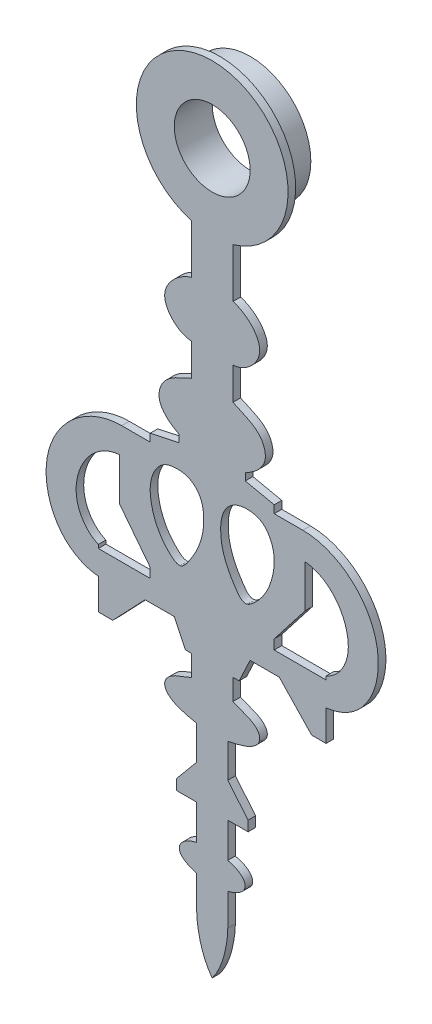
ISO-10303-21;
HEADER;
FILE_DESCRIPTION(('STEP AP214'),'2;1');
FILE_NAME('part.step','',(''),(''),'','','');
FILE_SCHEMA(('AUTOMOTIVE_DESIGN { 1 0 10303 214 1 1 1 1 }'));
ENDSEC;
DATA;
#1=APPLICATION_CONTEXT('core data for automotive mechanical design processes');
#2=APPLICATION_PROTOCOL_DEFINITION('international standard','automotive_design',2000,#1);
#3=PRODUCT_CONTEXT('',#1,'mechanical');
#4=PRODUCT('Part','Part','',(#3));
#5=PRODUCT_RELATED_PRODUCT_CATEGORY('part','',(#4));
#6=PRODUCT_DEFINITION_FORMATION('','',#4);
#7=PRODUCT_DEFINITION_CONTEXT('part definition',#1,'design');
#8=PRODUCT_DEFINITION('design','',#6,#7);
#9=PRODUCT_DEFINITION_SHAPE('','',#8);
#10=(LENGTH_UNIT() NAMED_UNIT(*) SI_UNIT(.MILLI.,.METRE.));
#11=(NAMED_UNIT(*) PLANE_ANGLE_UNIT() SI_UNIT($,.RADIAN.));
#12=(NAMED_UNIT(*) SI_UNIT($,.STERADIAN.) SOLID_ANGLE_UNIT());
#13=UNCERTAINTY_MEASURE_WITH_UNIT(LENGTH_MEASURE(1.E-05),#10,'distance_accuracy_value','');
#14=(GEOMETRIC_REPRESENTATION_CONTEXT(3) GLOBAL_UNCERTAINTY_ASSIGNED_CONTEXT((#13)) GLOBAL_UNIT_ASSIGNED_CONTEXT((#10,
#11,#12)) REPRESENTATION_CONTEXT('',''));
#15=CARTESIAN_POINT('',(0.,0.,0.));
#16=DIRECTION('',(0.,0.,1.));
#17=DIRECTION('',(1.,0.,0.));
#18=AXIS2_PLACEMENT_3D('',#15,#16,#17);
#19=CARTESIAN_POINT('',(1.61484434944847,-82.8913422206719,0.));
#20=DIRECTION('',(0.,0.,1.));
#21=DIRECTION('',(1.,0.,0.));
#22=AXIS2_PLACEMENT_3D('',#19,#20,#21);
#23=PLANE('',#22);
#24=DIRECTION('',(0.,1.,0.));
#25=VECTOR('',#24,1.);
#26=CARTESIAN_POINT('',(12.2237,-82.8913422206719,0.));
#27=LINE('',#26,#25);
#28=CARTESIAN_POINT('',(12.2237,-4.1886,0.));
#29=VERTEX_POINT('',#28);
#30=CARTESIAN_POINT('',(12.2237,1.4205,0.));
#31=VERTEX_POINT('',#30);
#32=EDGE_CURVE('E696',#29,#31,#27,.T.);
#33=ORIENTED_EDGE('',*,*,#32,.F.);
#34=DIRECTION('',(0.613567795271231,0.789642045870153,0.));
#35=VECTOR('',#34,1.);
#36=CARTESIAN_POINT('',(-29.9015618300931,-58.402458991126,0.));
#37=LINE('',#36,#35);
#38=CARTESIAN_POINT('',(8.16680000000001,-9.40970000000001,0.));
#39=VERTEX_POINT('',#38);
#40=EDGE_CURVE('E249',#39,#29,#37,.T.);
#41=ORIENTED_EDGE('',*,*,#40,.F.);
#42=DIRECTION('',(0.,1.,0.));
#43=VECTOR('',#42,1.);
#44=CARTESIAN_POINT('',(8.16680000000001,-82.8913422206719,0.));
#45=LINE('',#44,#43);
#46=CARTESIAN_POINT('',(8.16680000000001,-10.6797,0.));
#47=VERTEX_POINT('',#46);
#48=EDGE_CURVE('E243',#47,#39,#45,.T.);
#49=ORIENTED_EDGE('',*,*,#48,.F.);
#50=DIRECTION('',(-1.,0.,0.));
#51=VECTOR('',#50,1.);
#52=CARTESIAN_POINT('',(1.61484434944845,-10.6797,0.));
#53=LINE('',#52,#51);
#54=CARTESIAN_POINT('',(15.0106,-10.6797,0.));
#55=VERTEX_POINT('',#54);
#56=EDGE_CURVE('E451',#55,#47,#53,.T.);
#57=ORIENTED_EDGE('',*,*,#56,.F.);
#58=DIRECTION('',(0.,-1.,0.));
#59=VECTOR('',#58,1.);
#60=CARTESIAN_POINT('',(15.0106,-82.8913422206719,0.));
#61=LINE('',#60,#59);
#62=CARTESIAN_POINT('',(15.0106,-10.2211,0.));
#63=VERTEX_POINT('',#62);
#64=EDGE_CURVE('E703',#63,#55,#61,.T.);
#65=ORIENTED_EDGE('',*,*,#64,.F.);
#66=CARTESIAN_POINT('',(12.2237,1.4205,0.));
#67=CARTESIAN_POINT('',(13.9926301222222,1.29171621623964,0.));
#68=CARTESIAN_POINT('',(16.2842910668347,-0.288382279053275,0.));
#69=CARTESIAN_POINT('',(17.7901276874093,-3.42831104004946,0.));
#70=CARTESIAN_POINT('',(18.2062242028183,-6.96095026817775,0.));
#71=CARTESIAN_POINT('',(16.6940435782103,-9.47842434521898,0.));
#72=CARTESIAN_POINT('',(15.0106,-10.2211,0.));
#73=B_SPLINE_CURVE_WITH_KNOTS('',3,(#66,#67,#68,#69,#70,#71,#72),.UNSPECIFIED.,.F.,.F.,(4,1,1,1,
4),(0.,0.330322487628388,0.496737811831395,0.660859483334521,1.),.UNSPECIFIED.);
#74=EDGE_CURVE('E699',#31,#63,#73,.T.);
#75=ORIENTED_EDGE('',*,*,#74,.F.);
#76=EDGE_LOOP('',(#33,#41,#49,#57,#65,#75));
#77=FACE_BOUND('',#76,.T.);
#78=CARTESIAN_POINT('',(-12.2237,1.4205,0.));
#79=CARTESIAN_POINT('',(-13.9926301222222,1.29171621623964,0.));
#80=CARTESIAN_POINT('',(-16.2842910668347,-0.288382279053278,0.));
#81=CARTESIAN_POINT('',(-17.7901276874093,-3.42831104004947,0.));
#82=CARTESIAN_POINT('',(-18.2062242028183,-6.96095026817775,0.));
#83=CARTESIAN_POINT('',(-16.6940435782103,-9.47842434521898,0.));
#84=CARTESIAN_POINT('',(-15.0106,-10.2211,0.));
#85=B_SPLINE_CURVE_WITH_KNOTS('',3,(#78,#79,#80,#81,#82,#83,#84),.UNSPECIFIED.,.F.,.F.,(4,1,1,1,
4),(0.,0.330322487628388,0.496737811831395,0.660859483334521,1.),.UNSPECIFIED.);
#86=CARTESIAN_POINT('',(-12.2237,1.4205,0.));
#87=VERTEX_POINT('',#86);
#88=CARTESIAN_POINT('',(-15.0106,-10.2211,0.));
#89=VERTEX_POINT('',#88);
#90=EDGE_CURVE('E670',#87,#89,#85,.T.);
#91=ORIENTED_EDGE('',*,*,#90,.T.);
#92=DIRECTION('',(0.,-1.,0.));
#93=VECTOR('',#92,1.);
#94=CARTESIAN_POINT('',(-15.0106,-82.8913422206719,0.));
#95=LINE('',#94,#93);
#96=CARTESIAN_POINT('',(-15.0106,-10.6797,0.));
#97=VERTEX_POINT('',#96);
#98=EDGE_CURVE('E693',#89,#97,#95,.T.);
#99=ORIENTED_EDGE('',*,*,#98,.T.);
#100=DIRECTION('',(1.,0.,0.));
#101=VECTOR('',#100,1.);
#102=CARTESIAN_POINT('',(1.61484434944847,-10.6797,0.));
#103=LINE('',#102,#101);
#104=CARTESIAN_POINT('',(-8.1668,-10.6797,0.));
#105=VERTEX_POINT('',#104);
#106=EDGE_CURVE('E690',#97,#105,#103,.T.);
#107=ORIENTED_EDGE('',*,*,#106,.T.);
#108=DIRECTION('',(0.,1.,0.));
#109=VECTOR('',#108,1.);
#110=CARTESIAN_POINT('',(-8.1668,-82.8913422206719,0.));
#111=LINE('',#110,#109);
#112=CARTESIAN_POINT('',(-8.1668,-9.40970000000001,0.));
#113=VERTEX_POINT('',#112);
#114=EDGE_CURVE('E687',#105,#113,#111,.T.);
#115=ORIENTED_EDGE('',*,*,#114,.T.);
#116=DIRECTION('',(-0.613567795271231,0.789642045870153,0.));
#117=VECTOR('',#116,1.);
#118=CARTESIAN_POINT('',(31.1174280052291,-59.9672397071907,0.));
#119=LINE('',#118,#117);
#120=CARTESIAN_POINT('',(-12.2237,-4.1886,0.));
#121=VERTEX_POINT('',#120);
#122=EDGE_CURVE('E684',#113,#121,#119,.T.);
#123=ORIENTED_EDGE('',*,*,#122,.T.);
#124=DIRECTION('',(0.,1.,0.));
#125=VECTOR('',#124,1.);
#126=CARTESIAN_POINT('',(-12.2237,-82.8913422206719,0.));
#127=LINE('',#126,#125);
#128=EDGE_CURVE('E678',#121,#87,#127,.T.);
#129=ORIENTED_EDGE('',*,*,#128,.T.);
#130=EDGE_LOOP('',(#91,#99,#107,#115,#123,#129));
#131=FACE_BOUND('',#130,.T.);
#132=CARTESIAN_POINT('',(-4.639,3.6078,0.));
#133=CARTESIAN_POINT('',(-5.26073226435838,3.60447947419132,0.));
#134=CARTESIAN_POINT('',(-6.48156407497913,3.38393616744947,0.));
#135=CARTESIAN_POINT('',(-7.80576026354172,1.80331960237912,0.));
#136=CARTESIAN_POINT('',(-8.31101554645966,-0.268074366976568,0.));
#137=CARTESIAN_POINT('',(-7.87639049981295,-3.3078265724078,0.));
#138=CARTESIAN_POINT('',(-6.69836439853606,-5.67353887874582,0.));
#139=CARTESIAN_POINT('',(-4.22705947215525,-7.75266747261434,0.));
#140=CARTESIAN_POINT('',(-1.9390683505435,-4.69743424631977,0.));
#141=CARTESIAN_POINT('',(-0.828085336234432,-1.70209560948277,0.));
#142=CARTESIAN_POINT('',(-1.31844107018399,1.87238906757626,0.));
#143=CARTESIAN_POINT('',(-2.81111829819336,3.4035437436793,0.));
#144=CARTESIAN_POINT('',(-4.01997985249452,3.61110604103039,0.));
#145=CARTESIAN_POINT('',(-4.639,3.6078,0.));
#146=B_SPLINE_CURVE_WITH_KNOTS('',3,(#132,#133,#134,#135,#136,#137,#138,#139,#140,#141,#142,
#143,#144,#145),.UNSPECIFIED.,.T.,.F.,(4,1,1,1,1,1,1,1,1,1,1,4),(0.,0.0649753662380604,
0.126683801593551,0.209139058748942,0.287979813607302,0.448635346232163,0.508667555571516,
0.568592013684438,0.784772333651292,0.872763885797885,0.935308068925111,1.),.UNSPECIFIED.);
#147=CARTESIAN_POINT('',(-4.639,3.6078,0.));
#148=VERTEX_POINT('',#147);
#149=EDGE_CURVE('E662',#148,#148,#146,.T.);
#150=ORIENTED_EDGE('',*,*,#149,.T.);
#151=EDGE_LOOP('',(#150));
#152=FACE_BOUND('',#151,.T.);
#153=CARTESIAN_POINT('',(4.63900000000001,3.6078,0.));
#154=CARTESIAN_POINT('',(5.26073226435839,3.60447947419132,0.));
#155=CARTESIAN_POINT('',(6.48156407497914,3.38393616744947,0.));
#156=CARTESIAN_POINT('',(7.80576026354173,1.80331960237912,0.));
#157=CARTESIAN_POINT('',(8.31101554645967,-0.268074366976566,0.));
#158=CARTESIAN_POINT('',(7.87639049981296,-3.30782657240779,0.));
#159=CARTESIAN_POINT('',(6.69836439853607,-5.67353887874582,0.));
#160=CARTESIAN_POINT('',(4.22705947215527,-7.75266747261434,0.));
#161=CARTESIAN_POINT('',(1.93906835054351,-4.69743424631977,0.));
#162=CARTESIAN_POINT('',(0.828085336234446,-1.70209560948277,0.));
#163=CARTESIAN_POINT('',(1.31844107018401,1.87238906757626,0.));
#164=CARTESIAN_POINT('',(2.81111829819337,3.4035437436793,0.));
#165=CARTESIAN_POINT('',(4.01997985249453,3.61110604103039,0.));
#166=CARTESIAN_POINT('',(4.63900000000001,3.6078,0.));
#167=B_SPLINE_CURVE_WITH_KNOTS('',3,(#153,#154,#155,#156,#157,#158,#159,#160,#161,#162,#163,
#164,#165,#166),.UNSPECIFIED.,.T.,.F.,(4,1,1,1,1,1,1,1,1,1,1,4),(0.,0.0649753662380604,
0.126683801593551,0.209139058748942,0.287979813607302,0.448635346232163,0.508667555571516,
0.568592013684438,0.784772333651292,0.872763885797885,0.935308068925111,1.),.UNSPECIFIED.);
#168=CARTESIAN_POINT('',(4.63900000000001,3.6078,0.));
#169=VERTEX_POINT('',#168);
#170=EDGE_CURVE('E654',#169,#169,#167,.T.);
#171=ORIENTED_EDGE('',*,*,#170,.F.);
#172=EDGE_LOOP('',(#171));
#173=FACE_BOUND('',#172,.T.);
#174=DIRECTION('',(0.,1.,0.));
#175=VECTOR('',#174,1.);
#176=CARTESIAN_POINT('',(2.73500000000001,-82.8913422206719,0.));
#177=LINE('',#176,#175);
#178=CARTESIAN_POINT('',(2.735,26.3812799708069,0.));
#179=VERTEX_POINT('',#178);
#180=CARTESIAN_POINT('',(2.735,32.8812799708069,0.));
#181=VERTEX_POINT('',#180);
#182=EDGE_CURVE('E461',#179,#181,#177,.T.);
#183=ORIENTED_EDGE('',*,*,#182,.F.);
#184=CARTESIAN_POINT('',(2.735,19.1305241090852,0.));
#185=CARTESIAN_POINT('',(4.35697441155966,19.1508739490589,0.));
#186=CARTESIAN_POINT('',(8.24015316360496,22.6829265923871,0.));
#187=CARTESIAN_POINT('',(4.20715570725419,26.0435202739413,0.));
#188=CARTESIAN_POINT('',(2.735,26.3812799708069,0.));
#189=B_SPLINE_CURVE_WITH_KNOTS('',3,(#184,#185,#186,#187,#188),.UNSPECIFIED.,.F.,.F.,(4,1,4),
(0.,0.492043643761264,1.),.UNSPECIFIED.);
#190=CARTESIAN_POINT('',(2.735,19.1305241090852,0.));
#191=VERTEX_POINT('',#190);
#192=EDGE_CURVE('E650',#191,#179,#189,.T.);
#193=ORIENTED_EDGE('',*,*,#192,.F.);
#194=DIRECTION('',(0.,1.,0.));
#195=VECTOR('',#194,1.);
#196=CARTESIAN_POINT('',(2.73500000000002,-82.8913422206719,0.));
#197=LINE('',#196,#195);
#198=CARTESIAN_POINT('',(2.735,14.8805241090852,0.));
#199=VERTEX_POINT('',#198);
#200=EDGE_CURVE('E645',#199,#191,#197,.T.);
#201=ORIENTED_EDGE('',*,*,#200,.F.);
#202=CARTESIAN_POINT('',(4.3568,7.66271064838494,0.));
#203=CARTESIAN_POINT('',(5.17084683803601,8.08375666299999,0.));
#204=CARTESIAN_POINT('',(6.29795092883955,8.8407909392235,0.));
#205=CARTESIAN_POINT('',(7.05849046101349,10.3753969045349,0.));
#206=CARTESIAN_POINT('',(6.9871520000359,11.520743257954,0.));
#207=CARTESIAN_POINT('',(6.5161493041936,12.6188054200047,0.));
#208=CARTESIAN_POINT('',(5.12013511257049,13.9335295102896,0.));
#209=CARTESIAN_POINT('',(3.67204165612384,14.4144154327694,0.));
#210=CARTESIAN_POINT('',(2.735,14.8805241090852,0.));
#211=B_SPLINE_CURVE_WITH_KNOTS('',3,(#202,#203,#204,#205,#206,#207,#208,#209,#210),
.UNSPECIFIED.,.F.,.F.,(4,1,1,1,1,1,4),(0.,0.262865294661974,0.368853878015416,0.468953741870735,
0.577987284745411,0.700614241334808,1.),.UNSPECIFIED.);
#212=CARTESIAN_POINT('',(4.3568,7.66271064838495,0.));
#213=VERTEX_POINT('',#212);
#214=EDGE_CURVE('E641',#213,#199,#211,.T.);
#215=ORIENTED_EDGE('',*,*,#214,.F.);
#216=DIRECTION('',(0.,1.,0.));
#217=VECTOR('',#216,1.);
#218=CARTESIAN_POINT('',(4.3568,-82.8913422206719,0.));
#219=LINE('',#218,#217);
#220=CARTESIAN_POINT('',(4.3568,6.71021064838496,0.));
#221=VERTEX_POINT('',#220);
#222=EDGE_CURVE('E639',#221,#213,#219,.T.);
#223=ORIENTED_EDGE('',*,*,#222,.F.);
#224=DIRECTION('',(-0.978066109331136,0.208294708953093,0.));
#225=VECTOR('',#224,1.);
#226=CARTESIAN_POINT('',(19.9879742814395,3.3813038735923,0.));
#227=LINE('',#226,#225);
#228=CARTESIAN_POINT('',(8.16680000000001,5.89881064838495,0.));
#229=VERTEX_POINT('',#228);
#230=EDGE_CURVE('E637',#229,#221,#227,.T.);
#231=ORIENTED_EDGE('',*,*,#230,.F.);
#232=DIRECTION('',(0.,1.,0.));
#233=VECTOR('',#232,1.);
#234=CARTESIAN_POINT('',(8.16680000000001,-82.8913422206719,0.));
#235=LINE('',#234,#233);
#236=CARTESIAN_POINT('',(8.16680000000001,4.87581064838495,0.));
#237=VERTEX_POINT('',#236);
#238=EDGE_CURVE('E635',#237,#229,#235,.T.);
#239=ORIENTED_EDGE('',*,*,#238,.F.);
#240=DIRECTION('',(-1.,0.,0.));
#241=VECTOR('',#240,1.);
#242=CARTESIAN_POINT('',(1.61484434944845,4.87581064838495,0.));
#243=LINE('',#242,#241);
#244=CARTESIAN_POINT('',(11.9415,4.87581064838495,0.));
#245=VERTEX_POINT('',#244);
#246=EDGE_CURVE('E630',#245,#237,#243,.T.);
#247=ORIENTED_EDGE('',*,*,#246,.F.);
#248=CARTESIAN_POINT('',(11.9415,4.87581064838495,0.));
#249=CARTESIAN_POINT('',(14.3413187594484,4.87581064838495,0.));
#250=CARTESIAN_POINT('',(18.9540276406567,2.90078844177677,0.));
#251=CARTESIAN_POINT('',(23.6909925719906,-5.52379472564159,0.));
#252=CARTESIAN_POINT('',(20.1760192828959,-13.2990299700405,0.));
#253=CARTESIAN_POINT('',(15.0106,-13.8566893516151,0.));
#254=B_SPLINE_CURVE_WITH_KNOTS('',3,(#248,#249,#250,#251,#252,#253),.UNSPECIFIED.,.F.,.F.,(4,1,
1,4),(0.,0.259028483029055,0.508660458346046,1.),.UNSPECIFIED.);
#255=CARTESIAN_POINT('',(15.0106,-13.8566893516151,0.));
#256=VERTEX_POINT('',#255);
#257=EDGE_CURVE('E625',#245,#256,#254,.T.);
#258=ORIENTED_EDGE('',*,*,#257,.T.);
#259=DIRECTION('',(0.,1.,0.));
#260=VECTOR('',#259,1.);
#261=CARTESIAN_POINT('',(15.0106,-82.8913422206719,0.));
#262=LINE('',#261,#260);
#263=CARTESIAN_POINT('',(15.0106,-17.9278758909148,0.));
#264=VERTEX_POINT('',#263);
#265=EDGE_CURVE('E622',#264,#256,#262,.T.);
#266=ORIENTED_EDGE('',*,*,#265,.F.);
#267=DIRECTION('',(1.,0.,0.));
#268=VECTOR('',#267,1.);
#269=CARTESIAN_POINT('',(1.61484434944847,-17.9278758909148,0.));
#270=LINE('',#269,#268);
#271=CARTESIAN_POINT('',(13.1058,-17.9278758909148,0.));
#272=VERTEX_POINT('',#271);
#273=EDGE_CURVE('E620',#272,#264,#270,.T.);
#274=ORIENTED_EDGE('',*,*,#273,.F.);
#275=DIRECTION('',(0.68979477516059,-0.724004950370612,0.));
#276=VECTOR('',#275,1.);
#277=CARTESIAN_POINT('',(40.081928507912,-46.2418778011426,0.));
#278=LINE('',#277,#276);
#279=CARTESIAN_POINT('',(8.83720000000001,-13.4475758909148,0.));
#280=VERTEX_POINT('',#279);
#281=EDGE_CURVE('E618',#280,#272,#278,.T.);
#282=ORIENTED_EDGE('',*,*,#281,.F.);
#283=DIRECTION('',(1.,0.,0.));
#284=VECTOR('',#283,1.);
#285=CARTESIAN_POINT('',(1.61484434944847,-13.4475758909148,0.));
#286=LINE('',#285,#284);
#287=CARTESIAN_POINT('',(4.99189999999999,-13.4475758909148,0.));
#288=VERTEX_POINT('',#287);
#289=EDGE_CURVE('E616',#288,#280,#286,.T.);
#290=ORIENTED_EDGE('',*,*,#289,.F.);
#291=DIRECTION('',(0.426296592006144,0.904583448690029,0.));
#292=VECTOR('',#291,1.);
#293=CARTESIAN_POINT('',(-22.4007718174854,-71.5736740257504,0.));
#294=LINE('',#293,#292);
#295=CARTESIAN_POINT('',(3.54549999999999,-16.5167758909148,0.));
#296=VERTEX_POINT('',#295);
#297=EDGE_CURVE('E614',#296,#288,#294,.T.);
#298=ORIENTED_EDGE('',*,*,#297,.F.);
#299=DIRECTION('',(1.,0.,0.));
#300=VECTOR('',#299,1.);
#301=CARTESIAN_POINT('',(1.61484434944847,-16.5167758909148,0.));
#302=LINE('',#301,#300);
#303=CARTESIAN_POINT('',(2.735,-16.5167758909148,0.));
#304=VERTEX_POINT('',#303);
#305=EDGE_CURVE('E612',#304,#296,#302,.T.);
#306=ORIENTED_EDGE('',*,*,#305,.F.);
#307=DIRECTION('',(0.,1.,0.));
#308=VECTOR('',#307,1.);
#309=CARTESIAN_POINT('',(2.735,-82.8913422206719,0.));
#310=LINE('',#309,#308);
#311=CARTESIAN_POINT('',(2.735,-19.2683758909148,0.));
#312=VERTEX_POINT('',#311);
#313=EDGE_CURVE('E607',#312,#304,#310,.T.);
#314=ORIENTED_EDGE('',*,*,#313,.F.);
#315=CARTESIAN_POINT('',(2.735,-19.2683758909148,0.));
#316=CARTESIAN_POINT('',(3.69979956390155,-19.7572207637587,0.));
#317=CARTESIAN_POINT('',(5.16773792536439,-19.9801961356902,0.));
#318=CARTESIAN_POINT('',(6.25503545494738,-21.2601373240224,0.));
#319=CARTESIAN_POINT('',(6.30473104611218,-22.1146556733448,0.));
#320=CARTESIAN_POINT('',(5.74155724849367,-22.858628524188,0.));
#321=CARTESIAN_POINT('',(4.33609583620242,-23.6897810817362,0.));
#322=CARTESIAN_POINT('',(2.99359812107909,-23.9594299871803,0.));
#323=CARTESIAN_POINT('',(2.05000000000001,-24.1577893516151,0.));
#324=B_SPLINE_CURVE_WITH_KNOTS('',3,(#315,#316,#317,#318,#319,#320,#321,#322,#323),
.UNSPECIFIED.,.F.,.F.,(4,1,1,1,1,1,4),(0.,0.338643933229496,0.424709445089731,0.497744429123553,
0.584732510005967,0.698034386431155,1.),.UNSPECIFIED.);
#325=CARTESIAN_POINT('',(2.05000000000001,-24.1577893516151,0.));
#326=VERTEX_POINT('',#325);
#327=EDGE_CURVE('E602',#312,#326,#324,.T.);
#328=ORIENTED_EDGE('',*,*,#327,.T.);
#329=DIRECTION('',(0.,1.,0.));
#330=VECTOR('',#329,1.);
#331=CARTESIAN_POINT('',(2.05000000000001,-82.8913422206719,0.));
#332=LINE('',#331,#330);
#333=CARTESIAN_POINT('',(2.05000000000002,-28.6027893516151,0.));
#334=VERTEX_POINT('',#333);
#335=EDGE_CURVE('E599',#334,#326,#332,.T.);
#336=ORIENTED_EDGE('',*,*,#335,.F.);
#337=DIRECTION('',(-0.641009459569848,0.767532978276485,0.));
#338=VECTOR('',#337,1.);
#339=CARTESIAN_POINT('',(28.5809429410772,-60.3704541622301,0.));
#340=LINE('',#339,#338);
#341=CARTESIAN_POINT('',(4.73110000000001,-31.8130893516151,0.));
#342=VERTEX_POINT('',#341);
#343=EDGE_CURVE('E597',#342,#334,#340,.T.);
#344=ORIENTED_EDGE('',*,*,#343,.F.);
#345=DIRECTION('',(0.,1.,0.));
#346=VECTOR('',#345,1.);
#347=CARTESIAN_POINT('',(4.73110000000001,-82.8913422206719,0.));
#348=LINE('',#347,#346);
#349=CARTESIAN_POINT('',(4.73110000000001,-33.1536893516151,0.));
#350=VERTEX_POINT('',#349);
#351=EDGE_CURVE('E595',#350,#342,#348,.T.);
#352=ORIENTED_EDGE('',*,*,#351,.F.);
#353=DIRECTION('',(1.,0.,0.));
#354=VECTOR('',#353,1.);
#355=CARTESIAN_POINT('',(1.61484434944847,-33.1536893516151,0.));
#356=LINE('',#355,#354);
#357=CARTESIAN_POINT('',(2.05000000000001,-33.1536893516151,0.));
#358=VERTEX_POINT('',#357);
#359=EDGE_CURVE('E593',#358,#350,#356,.T.);
#360=ORIENTED_EDGE('',*,*,#359,.F.);
#361=DIRECTION('',(0.,1.,0.));
#362=VECTOR('',#361,1.);
#363=CARTESIAN_POINT('',(2.05000000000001,-82.8913422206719,0.));
#364=LINE('',#363,#362);
#365=CARTESIAN_POINT('',(2.05000000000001,-37.7522,0.));
#366=VERTEX_POINT('',#365);
#367=EDGE_CURVE('E588',#366,#358,#364,.T.);
#368=ORIENTED_EDGE('',*,*,#367,.F.);
#369=CARTESIAN_POINT('',(2.05000000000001,-37.7522,0.));
#370=CARTESIAN_POINT('',(2.73777866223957,-37.9162860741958,0.));
#371=CARTESIAN_POINT('',(3.71545369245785,-38.2463821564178,0.));
#372=CARTESIAN_POINT('',(4.40865929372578,-39.3011311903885,0.));
#373=CARTESIAN_POINT('',(4.26743006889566,-40.1132299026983,0.));
#374=CARTESIAN_POINT('',(3.39471256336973,-40.8273855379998,0.));
#375=CARTESIAN_POINT('',(2.60532620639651,-41.1399060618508,0.));
#376=CARTESIAN_POINT('',(2.05000000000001,-41.28,0.));
#377=B_SPLINE_CURVE_WITH_KNOTS('',3,(#369,#370,#371,#372,#373,#374,#375,#376),.UNSPECIFIED.,.F.,
.F.,(4,1,1,1,1,4),(0.,0.353500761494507,0.472036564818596,0.582770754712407,0.721161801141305,
1.),.UNSPECIFIED.);
#378=CARTESIAN_POINT('',(2.05000000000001,-41.28,0.));
#379=VERTEX_POINT('',#378);
#380=EDGE_CURVE('E583',#366,#379,#377,.T.);
#381=ORIENTED_EDGE('',*,*,#380,.T.);
#382=DIRECTION('',(0.,1.,0.));
#383=VECTOR('',#382,1.);
#384=CARTESIAN_POINT('',(2.05000000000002,-82.8913422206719,0.));
#385=LINE('',#384,#383);
#386=CARTESIAN_POINT('',(2.05000000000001,-45.5133,0.));
#387=VERTEX_POINT('',#386);
#388=EDGE_CURVE('E577',#387,#379,#385,.T.);
#389=ORIENTED_EDGE('',*,*,#388,.F.);
#390=CARTESIAN_POINT('',(0.,-52.2,0.));
#391=CARTESIAN_POINT('',(0.705020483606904,-51.267326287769,0.));
#392=CARTESIAN_POINT('',(1.4241775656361,-49.6375893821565,0.));
#393=CARTESIAN_POINT('',(1.91673203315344,-47.3109379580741,0.));
#394=CARTESIAN_POINT('',(2.05000000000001,-46.1314265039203,0.));
#395=CARTESIAN_POINT('',(2.05000000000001,-45.5133,0.));
#396=B_SPLINE_CURVE_WITH_KNOTS('',3,(#390,#391,#392,#393,#394,#395),.UNSPECIFIED.,.F.,.F.,(4,1,
1,4),(0.,0.490623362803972,0.745278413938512,1.),.UNSPECIFIED.);
#397=CARTESIAN_POINT('',(0.,-52.2,0.));
#398=VERTEX_POINT('',#397);
#399=EDGE_CURVE('E570',#398,#387,#396,.T.);
#400=ORIENTED_EDGE('',*,*,#399,.F.);
#401=CARTESIAN_POINT('',(0.,-52.2,0.));
#402=CARTESIAN_POINT('',(-0.705020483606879,-51.267326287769,0.));
#403=CARTESIAN_POINT('',(-1.42417756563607,-49.6375893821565,0.));
#404=CARTESIAN_POINT('',(-1.91673203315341,-47.3109379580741,0.));
#405=CARTESIAN_POINT('',(-2.04999999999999,-46.1314265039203,0.));
#406=CARTESIAN_POINT('',(-2.04999999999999,-45.5133,0.));
#407=B_SPLINE_CURVE_WITH_KNOTS('',3,(#401,#402,#403,#404,#405,#406),.UNSPECIFIED.,.F.,.F.,(4,1,
1,4),(0.,0.490623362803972,0.745278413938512,1.),.UNSPECIFIED.);
#408=CARTESIAN_POINT('',(-2.04999999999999,-45.5133,0.));
#409=VERTEX_POINT('',#408);
#410=EDGE_CURVE('E565',#398,#409,#407,.T.);
#411=ORIENTED_EDGE('',*,*,#410,.T.);
#412=DIRECTION('',(0.,1.,0.));
#413=VECTOR('',#412,1.);
#414=CARTESIAN_POINT('',(-2.04999999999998,-82.8913422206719,0.));
#415=LINE('',#414,#413);
#416=CARTESIAN_POINT('',(-2.04999999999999,-41.28,0.));
#417=VERTEX_POINT('',#416);
#418=EDGE_CURVE('E559',#409,#417,#415,.T.);
#419=ORIENTED_EDGE('',*,*,#418,.T.);
#420=CARTESIAN_POINT('',(-2.04999999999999,-37.7522,0.));
#421=CARTESIAN_POINT('',(-2.73777866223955,-37.9162860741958,0.));
#422=CARTESIAN_POINT('',(-3.71545369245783,-38.2463821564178,0.));
#423=CARTESIAN_POINT('',(-4.40865929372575,-39.3011311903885,0.));
#424=CARTESIAN_POINT('',(-4.26743006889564,-40.1132299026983,0.));
#425=CARTESIAN_POINT('',(-3.3947125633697,-40.8273855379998,0.));
#426=CARTESIAN_POINT('',(-2.60532620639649,-41.1399060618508,0.));
#427=CARTESIAN_POINT('',(-2.04999999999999,-41.28,0.));
#428=B_SPLINE_CURVE_WITH_KNOTS('',3,(#420,#421,#422,#423,#424,#425,#426,#427),.UNSPECIFIED.,.F.,
.F.,(4,1,1,1,1,4),(0.,0.353500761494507,0.472036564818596,0.582770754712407,0.721161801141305,
1.),.UNSPECIFIED.);
#429=CARTESIAN_POINT('',(-2.04999999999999,-37.7522,0.));
#430=VERTEX_POINT('',#429);
#431=EDGE_CURVE('E554',#430,#417,#428,.T.);
#432=ORIENTED_EDGE('',*,*,#431,.F.);
#433=DIRECTION('',(0.,1.,0.));
#434=VECTOR('',#433,1.);
#435=CARTESIAN_POINT('',(-2.04999999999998,-82.8913422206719,0.));
#436=LINE('',#435,#434);
#437=CARTESIAN_POINT('',(-2.04999999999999,-33.1536893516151,0.));
#438=VERTEX_POINT('',#437);
#439=EDGE_CURVE('E551',#430,#438,#436,.T.);
#440=ORIENTED_EDGE('',*,*,#439,.T.);
#441=DIRECTION('',(-1.,0.,0.));
#442=VECTOR('',#441,1.);
#443=CARTESIAN_POINT('',(1.61484434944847,-33.1536893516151,0.));
#444=LINE('',#443,#442);
#445=CARTESIAN_POINT('',(-4.73109999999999,-33.1536893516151,0.));
#446=VERTEX_POINT('',#445);
#447=EDGE_CURVE('E548',#438,#446,#444,.T.);
#448=ORIENTED_EDGE('',*,*,#447,.T.);
#449=DIRECTION('',(0.,1.,0.));
#450=VECTOR('',#449,1.);
#451=CARTESIAN_POINT('',(-4.73109999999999,-82.8913422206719,0.));
#452=LINE('',#451,#450);
#453=CARTESIAN_POINT('',(-4.73109999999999,-31.8130893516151,0.));
#454=VERTEX_POINT('',#453);
#455=EDGE_CURVE('E545',#446,#454,#452,.T.);
#456=ORIENTED_EDGE('',*,*,#455,.T.);
#457=DIRECTION('',(0.641009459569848,0.767532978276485,0.));
#458=VECTOR('',#457,1.);
#459=CARTESIAN_POINT('',(-27.2538860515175,-58.7814605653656,0.));
#460=LINE('',#459,#458);
#461=CARTESIAN_POINT('',(-2.05,-28.6027893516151,0.));
#462=VERTEX_POINT('',#461);
#463=EDGE_CURVE('E542',#454,#462,#460,.T.);
#464=ORIENTED_EDGE('',*,*,#463,.T.);
#465=DIRECTION('',(0.,1.,0.));
#466=VECTOR('',#465,1.);
#467=CARTESIAN_POINT('',(-2.04999999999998,-82.8913422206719,0.));
#468=LINE('',#467,#466);
#469=CARTESIAN_POINT('',(-2.04999999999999,-24.1577893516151,0.));
#470=VERTEX_POINT('',#469);
#471=EDGE_CURVE('E536',#462,#470,#468,.T.);
#472=ORIENTED_EDGE('',*,*,#471,.T.);
#473=CARTESIAN_POINT('',(-2.73499999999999,-19.2683758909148,0.));
#474=CARTESIAN_POINT('',(-3.69979956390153,-19.7572207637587,0.));
#475=CARTESIAN_POINT('',(-5.16773792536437,-19.9801961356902,0.));
#476=CARTESIAN_POINT('',(-6.25503545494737,-21.2601373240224,0.));
#477=CARTESIAN_POINT('',(-6.30473104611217,-22.1146556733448,0.));
#478=CARTESIAN_POINT('',(-5.74155724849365,-22.858628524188,0.));
#479=CARTESIAN_POINT('',(-4.3360958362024,-23.6897810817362,0.));
#480=CARTESIAN_POINT('',(-2.99359812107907,-23.9594299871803,0.));
#481=CARTESIAN_POINT('',(-2.04999999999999,-24.1577893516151,0.));
#482=B_SPLINE_CURVE_WITH_KNOTS('',3,(#473,#474,#475,#476,#477,#478,#479,#480,#481),
.UNSPECIFIED.,.F.,.F.,(4,1,1,1,1,1,4),(0.,0.338643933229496,0.424709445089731,0.497744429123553,
0.584732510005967,0.698034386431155,1.),.UNSPECIFIED.);
#483=CARTESIAN_POINT('',(-2.73499999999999,-19.2683758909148,0.));
#484=VERTEX_POINT('',#483);
#485=EDGE_CURVE('E531',#484,#470,#482,.T.);
#486=ORIENTED_EDGE('',*,*,#485,.F.);
#487=DIRECTION('',(0.,1.,0.));
#488=VECTOR('',#487,1.);
#489=CARTESIAN_POINT('',(-2.73499999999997,-82.8913422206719,0.));
#490=LINE('',#489,#488);
#491=CARTESIAN_POINT('',(-2.73499999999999,-16.5167758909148,0.));
#492=VERTEX_POINT('',#491);
#493=EDGE_CURVE('E528',#484,#492,#490,.T.);
#494=ORIENTED_EDGE('',*,*,#493,.T.);
#495=DIRECTION('',(-1.,0.,0.));
#496=VECTOR('',#495,1.);
#497=CARTESIAN_POINT('',(1.61484434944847,-16.5167758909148,0.));
#498=LINE('',#497,#496);
#499=CARTESIAN_POINT('',(-3.54549999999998,-16.5167758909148,0.));
#500=VERTEX_POINT('',#499);
#501=EDGE_CURVE('E525',#492,#500,#498,.T.);
#502=ORIENTED_EDGE('',*,*,#501,.T.);
#503=DIRECTION('',(-0.426296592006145,0.904583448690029,0.));
#504=VECTOR('',#503,1.);
#505=CARTESIAN_POINT('',(22.9876992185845,-72.8191092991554,0.));
#506=LINE('',#505,#504);
#507=CARTESIAN_POINT('',(-4.99189999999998,-13.4475758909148,0.));
#508=VERTEX_POINT('',#507);
#509=EDGE_CURVE('E522',#500,#508,#506,.T.);
#510=ORIENTED_EDGE('',*,*,#509,.T.);
#511=DIRECTION('',(-1.,0.,0.));
#512=VECTOR('',#511,1.);
#513=CARTESIAN_POINT('',(1.61484434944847,-13.4475758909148,0.));
#514=LINE('',#513,#512);
#515=CARTESIAN_POINT('',(-8.83719999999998,-13.4475758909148,0.));
#516=VERTEX_POINT('',#515);
#517=EDGE_CURVE('E519',#508,#516,#514,.T.);
#518=ORIENTED_EDGE('',*,*,#517,.T.);
#519=DIRECTION('',(-0.68979477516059,-0.724004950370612,0.));
#520=VECTOR('',#519,1.);
#521=CARTESIAN_POINT('',(-38.5451882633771,-44.6289233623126,0.));
#522=LINE('',#521,#520);
#523=CARTESIAN_POINT('',(-13.1058,-17.9278758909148,0.));
#524=VERTEX_POINT('',#523);
#525=EDGE_CURVE('E516',#516,#524,#522,.T.);
#526=ORIENTED_EDGE('',*,*,#525,.T.);
#527=DIRECTION('',(-1.,0.,0.));
#528=VECTOR('',#527,1.);
#529=CARTESIAN_POINT('',(1.61484434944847,-17.9278758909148,0.));
#530=LINE('',#529,#528);
#531=CARTESIAN_POINT('',(-15.0106,-17.9278758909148,0.));
#532=VERTEX_POINT('',#531);
#533=EDGE_CURVE('E513',#524,#532,#530,.T.);
#534=ORIENTED_EDGE('',*,*,#533,.T.);
#535=DIRECTION('',(0.,1.,0.));
#536=VECTOR('',#535,1.);
#537=CARTESIAN_POINT('',(-15.0106,-82.8913422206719,0.));
#538=LINE('',#537,#536);
#539=CARTESIAN_POINT('',(-15.0106,-13.8566893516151,0.));
#540=VERTEX_POINT('',#539);
#541=EDGE_CURVE('E507',#532,#540,#538,.T.);
#542=ORIENTED_EDGE('',*,*,#541,.T.);
#543=CARTESIAN_POINT('',(-11.9415,4.87581064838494,0.));
#544=CARTESIAN_POINT('',(-14.3413187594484,4.87581064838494,0.));
#545=CARTESIAN_POINT('',(-18.9540276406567,2.90078844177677,0.));
#546=CARTESIAN_POINT('',(-23.6909925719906,-5.5237947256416,0.));
#547=CARTESIAN_POINT('',(-20.1760192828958,-13.2990299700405,0.));
#548=CARTESIAN_POINT('',(-15.0106,-13.8566893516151,0.));
#549=B_SPLINE_CURVE_WITH_KNOTS('',3,(#543,#544,#545,#546,#547,#548),.UNSPECIFIED.,.F.,.F.,(4,1,
1,4),(0.,0.259028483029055,0.508660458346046,1.),.UNSPECIFIED.);
#550=CARTESIAN_POINT('',(-11.9415,4.87581064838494,0.));
#551=VERTEX_POINT('',#550);
#552=EDGE_CURVE('E502',#551,#540,#549,.T.);
#553=ORIENTED_EDGE('',*,*,#552,.F.);
#554=DIRECTION('',(1.,0.,0.));
#555=VECTOR('',#554,1.);
#556=CARTESIAN_POINT('',(1.61484434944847,4.87581064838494,0.));
#557=LINE('',#556,#555);
#558=CARTESIAN_POINT('',(-8.16679999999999,4.87581064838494,0.));
#559=VERTEX_POINT('',#558);
#560=EDGE_CURVE('E499',#551,#559,#557,.T.);
#561=ORIENTED_EDGE('',*,*,#560,.T.);
#562=DIRECTION('',(0.,1.,0.));
#563=VECTOR('',#562,1.);
#564=CARTESIAN_POINT('',(-8.16679999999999,-82.8913422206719,0.));
#565=LINE('',#564,#563);
#566=CARTESIAN_POINT('',(-8.16679999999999,5.89881064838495,0.));
#567=VERTEX_POINT('',#566);
#568=EDGE_CURVE('E496',#559,#567,#565,.T.);
#569=ORIENTED_EDGE('',*,*,#568,.T.);
#570=DIRECTION('',(0.978066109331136,0.208294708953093,0.));
#571=VECTOR('',#570,1.);
#572=CARTESIAN_POINT('',(-16.8984110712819,4.03927541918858,0.));
#573=LINE('',#572,#571);
#574=CARTESIAN_POINT('',(-4.35679999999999,6.71021064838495,0.));
#575=VERTEX_POINT('',#574);
#576=EDGE_CURVE('E493',#567,#575,#573,.T.);
#577=ORIENTED_EDGE('',*,*,#576,.T.);
#578=DIRECTION('',(0.,1.,0.));
#579=VECTOR('',#578,1.);
#580=CARTESIAN_POINT('',(-4.35679999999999,-82.8913422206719,0.));
#581=LINE('',#580,#579);
#582=CARTESIAN_POINT('',(-4.35679999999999,7.66271064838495,0.));
#583=VERTEX_POINT('',#582);
#584=EDGE_CURVE('E487',#575,#583,#581,.T.);
#585=ORIENTED_EDGE('',*,*,#584,.T.);
#586=CARTESIAN_POINT('',(-4.35679999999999,7.66271064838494,0.));
#587=CARTESIAN_POINT('',(-5.170846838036,8.08375666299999,0.));
#588=CARTESIAN_POINT('',(-6.29795092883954,8.8407909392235,0.));
#589=CARTESIAN_POINT('',(-7.05849046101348,10.3753969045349,0.));
#590=CARTESIAN_POINT('',(-6.98715200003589,11.520743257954,0.));
#591=CARTESIAN_POINT('',(-6.51614930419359,12.6188054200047,0.));
#592=CARTESIAN_POINT('',(-5.12013511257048,13.9335295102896,0.));
#593=CARTESIAN_POINT('',(-3.67204165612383,14.4144154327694,0.));
#594=CARTESIAN_POINT('',(-2.73499999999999,14.8805241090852,0.));
#595=B_SPLINE_CURVE_WITH_KNOTS('',3,(#586,#587,#588,#589,#590,#591,#592,#593,#594),
.UNSPECIFIED.,.F.,.F.,(4,1,1,1,1,1,4),(0.,0.262865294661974,0.368853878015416,0.468953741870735,
0.577987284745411,0.700614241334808,1.),.UNSPECIFIED.);
#596=CARTESIAN_POINT('',(-2.73499999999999,14.8805241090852,0.));
#597=VERTEX_POINT('',#596);
#598=EDGE_CURVE('E482',#583,#597,#595,.T.);
#599=ORIENTED_EDGE('',*,*,#598,.T.);
#600=DIRECTION('',(0.,1.,0.));
#601=VECTOR('',#600,1.);
#602=CARTESIAN_POINT('',(-2.73499999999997,-82.8913422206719,0.));
#603=LINE('',#602,#601);
#604=CARTESIAN_POINT('',(-2.735,19.1305241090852,0.));
#605=VERTEX_POINT('',#604);
#606=EDGE_CURVE('E476',#597,#605,#603,.T.);
#607=ORIENTED_EDGE('',*,*,#606,.T.);
#608=CARTESIAN_POINT('',(-2.73499999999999,19.1305241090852,0.));
#609=CARTESIAN_POINT('',(-4.35697441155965,19.1508739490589,0.));
#610=CARTESIAN_POINT('',(-8.24015316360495,22.6829265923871,0.));
#611=CARTESIAN_POINT('',(-4.20715570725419,26.0435202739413,0.));
#612=CARTESIAN_POINT('',(-2.735,26.3812799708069,0.));
#613=B_SPLINE_CURVE_WITH_KNOTS('',3,(#608,#609,#610,#611,#612),.UNSPECIFIED.,.F.,.F.,(4,1,4),
(0.,0.492043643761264,1.),.UNSPECIFIED.);
#614=CARTESIAN_POINT('',(-2.735,26.3812799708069,0.));
#615=VERTEX_POINT('',#614);
#616=EDGE_CURVE('E471',#605,#615,#613,.T.);
#617=ORIENTED_EDGE('',*,*,#616,.T.);
#618=DIRECTION('',(0.,1.,0.));
#619=VECTOR('',#618,1.);
#620=CARTESIAN_POINT('',(-2.73499999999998,-82.8913422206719,0.));
#621=LINE('',#620,#619);
#622=CARTESIAN_POINT('',(-2.735,32.8812799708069,0.));
#623=VERTEX_POINT('',#622);
#624=EDGE_CURVE('E468',#615,#623,#621,.T.);
#625=ORIENTED_EDGE('',*,*,#624,.T.);
#626=CARTESIAN_POINT('',(0.,42.5,0.));
#627=DIRECTION('',(0.,0.,1.));
#628=DIRECTION('',(1.,0.,0.));
#629=AXIS2_PLACEMENT_3D('',#626,#627,#628);
#630=CIRCLE('',#629,10.);
#631=EDGE_CURVE('E464',#181,#623,#630,.T.);
#632=ORIENTED_EDGE('',*,*,#631,.F.);
#633=EDGE_LOOP('',(#183,#193,#201,#215,#223,#231,#239,#247,#258,#266,#274,#282,#290,#298,#306,
#314,#328,#336,#344,#352,#360,#368,#381,#389,#400,#411,#419,#432,#440,#448,#456,#464,#472,#486,
#494,#502,#510,#518,#526,#534,#542,#553,#561,#569,#577,#585,#599,#607,#617,#625,#632));
#634=FACE_BOUND('',#633,.T.);
#635=CARTESIAN_POINT('',(0.,42.5,0.));
#636=DIRECTION('',(0.,0.,1.));
#637=DIRECTION('',(1.,0.,0.));
#638=AXIS2_PLACEMENT_3D('',#635,#636,#637);
#639=CIRCLE('',#638,8.);
#640=CARTESIAN_POINT('',(8.,42.5,0.));
#641=VERTEX_POINT('',#640);
#642=EDGE_CURVE('E11',#641,#641,#639,.F.);
#643=ORIENTED_EDGE('',*,*,#642,.F.);
#644=EDGE_LOOP('',(#643));
#645=FACE_BOUND('',#644,.T.);
#646=ADVANCED_FACE('F32',(#77,#131,#152,#173,#634,#645),#23,.F.);
#647=CARTESIAN_POINT('',(12.2237,-82.8913422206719,1.));
#648=DIRECTION('',(-1.,0.,0.));
#649=DIRECTION('',(0.,0.,1.));
#650=AXIS2_PLACEMENT_3D('',#647,#648,#649);
#651=PLANE('',#650);
#652=ORIENTED_EDGE('',*,*,#32,.T.);
#653=DIRECTION('',(0.,0.,-1.));
#654=VECTOR('',#653,1.);
#655=CARTESIAN_POINT('',(12.2237,1.4205,1.));
#656=LINE('',#655,#654);
#657=CARTESIAN_POINT('',(12.2237,1.4205,1.));
#658=VERTEX_POINT('',#657);
#659=EDGE_CURVE('E41',#658,#31,#656,.T.);
#660=ORIENTED_EDGE('',*,*,#659,.F.);
#661=DIRECTION('',(0.,1.,0.));
#662=VECTOR('',#661,1.);
#663=CARTESIAN_POINT('',(12.2237,-82.8913422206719,1.));
#664=LINE('',#663,#662);
#665=CARTESIAN_POINT('',(12.2237,-4.1886,1.));
#666=VERTEX_POINT('',#665);
#667=EDGE_CURVE('E935',#666,#658,#664,.T.);
#668=ORIENTED_EDGE('',*,*,#667,.F.);
#669=DIRECTION('',(0.,0.,-1.));
#670=VECTOR('',#669,1.);
#671=CARTESIAN_POINT('',(12.2237,-4.1886,1.));
#672=LINE('',#671,#670);
#673=EDGE_CURVE('E712',#666,#29,#672,.T.);
#674=ORIENTED_EDGE('',*,*,#673,.T.);
#675=EDGE_LOOP('',(#652,#660,#668,#674));
#676=FACE_BOUND('',#675,.T.);
#677=ADVANCED_FACE('F899',(#676),#651,.F.);
#678=CARTESIAN_POINT('',(12.2237,1.4205,1.));
#679=CARTESIAN_POINT('',(13.9926301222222,1.29171621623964,1.));
#680=CARTESIAN_POINT('',(16.2842910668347,-0.288382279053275,1.));
#681=CARTESIAN_POINT('',(17.7901276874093,-3.42831104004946,1.));
#682=CARTESIAN_POINT('',(18.2062242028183,-6.96095026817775,1.));
#683=CARTESIAN_POINT('',(16.6940435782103,-9.47842434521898,1.));
#684=CARTESIAN_POINT('',(15.0106,-10.2211,1.));
#685=B_SPLINE_CURVE_WITH_KNOTS('',3,(#678,#679,#680,#681,#682,#683,#684),.UNSPECIFIED.,.F.,.F.,
(4,1,1,1,4),(0.,0.330322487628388,0.496737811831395,0.660859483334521,1.),.UNSPECIFIED.);
#686=DIRECTION('',(0.,0.,-1.));
#687=VECTOR('',#686,1.);
#688=SURFACE_OF_LINEAR_EXTRUSION('',#685,#687);
#689=ORIENTED_EDGE('',*,*,#74,.T.);
#690=DIRECTION('',(0.,0.,-1.));
#691=VECTOR('',#690,1.);
#692=CARTESIAN_POINT('',(15.0106,-10.2211,1.));
#693=LINE('',#692,#691);
#694=CARTESIAN_POINT('',(15.0106,-10.2211,1.));
#695=VERTEX_POINT('',#694);
#696=EDGE_CURVE('E717',#695,#63,#693,.T.);
#697=ORIENTED_EDGE('',*,*,#696,.F.);
#698=EDGE_CURVE('E930',#658,#695,#685,.T.);
#699=ORIENTED_EDGE('',*,*,#698,.F.);
#700=ORIENTED_EDGE('',*,*,#659,.T.);
#701=EDGE_LOOP('',(#689,#697,#699,#700));
#702=FACE_BOUND('',#701,.T.);
#703=ADVANCED_FACE('F905',(#702),#688,.F.);
#704=CARTESIAN_POINT('',(15.0106,-82.8913422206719,1.));
#705=DIRECTION('',(1.,0.,0.));
#706=DIRECTION('',(0.,0.,-1.));
#707=AXIS2_PLACEMENT_3D('',#704,#705,#706);
#708=PLANE('',#707);
#709=ORIENTED_EDGE('',*,*,#64,.T.);
#710=DIRECTION('',(0.,0.,-1.));
#711=VECTOR('',#710,1.);
#712=CARTESIAN_POINT('',(15.0106,-10.6797,1.));
#713=LINE('',#712,#711);
#714=CARTESIAN_POINT('',(15.0106,-10.6797,1.));
#715=VERTEX_POINT('',#714);
#716=EDGE_CURVE('E452',#715,#55,#713,.T.);
#717=ORIENTED_EDGE('',*,*,#716,.F.);
#718=DIRECTION('',(0.,-1.,0.));
#719=VECTOR('',#718,1.);
#720=CARTESIAN_POINT('',(15.0106,-82.8913422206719,1.));
#721=LINE('',#720,#719);
#722=EDGE_CURVE('E443',#695,#715,#721,.T.);
#723=ORIENTED_EDGE('',*,*,#722,.F.);
#724=ORIENTED_EDGE('',*,*,#696,.T.);
#725=EDGE_LOOP('',(#709,#717,#723,#724));
#726=FACE_BOUND('',#725,.T.);
#727=ADVANCED_FACE('F922',(#726),#708,.F.);
#728=CARTESIAN_POINT('',(1.61484434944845,-10.6797,1.));
#729=DIRECTION('',(0.,-1.,0.));
#730=DIRECTION('',(1.,0.,0.));
#731=AXIS2_PLACEMENT_3D('',#728,#729,#730);
#732=PLANE('',#731);
#733=ORIENTED_EDGE('',*,*,#56,.T.);
#734=DIRECTION('',(0.,0.,-1.));
#735=VECTOR('',#734,1.);
#736=CARTESIAN_POINT('',(8.16680000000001,-10.6797,1.));
#737=LINE('',#736,#735);
#738=CARTESIAN_POINT('',(8.16680000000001,-10.6797,1.));
#739=VERTEX_POINT('',#738);
#740=EDGE_CURVE('E448',#739,#47,#737,.T.);
#741=ORIENTED_EDGE('',*,*,#740,.F.);
#742=DIRECTION('',(-1.,0.,0.));
#743=VECTOR('',#742,1.);
#744=CARTESIAN_POINT('',(1.61484434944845,-10.6797,1.));
#745=LINE('',#744,#743);
#746=EDGE_CURVE('E437',#715,#739,#745,.T.);
#747=ORIENTED_EDGE('',*,*,#746,.F.);
#748=ORIENTED_EDGE('',*,*,#716,.T.);
#749=EDGE_LOOP('',(#733,#741,#747,#748));
#750=FACE_BOUND('',#749,.T.);
#751=ADVANCED_FACE('F449',(#750),#732,.F.);
#752=CARTESIAN_POINT('',(8.16680000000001,-82.8913422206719,1.));
#753=DIRECTION('',(-1.,0.,0.));
#754=DIRECTION('',(0.,0.,1.));
#755=AXIS2_PLACEMENT_3D('',#752,#753,#754);
#756=PLANE('',#755);
#757=ORIENTED_EDGE('',*,*,#48,.T.);
#758=DIRECTION('',(0.,0.,-1.));
#759=VECTOR('',#758,1.);
#760=CARTESIAN_POINT('',(8.16680000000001,-9.40970000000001,1.));
#761=LINE('',#760,#759);
#762=CARTESIAN_POINT('',(8.16680000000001,-9.40970000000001,1.));
#763=VERTEX_POINT('',#762);
#764=EDGE_CURVE('E453',#763,#39,#761,.T.);
#765=ORIENTED_EDGE('',*,*,#764,.F.);
#766=DIRECTION('',(0.,1.,0.));
#767=VECTOR('',#766,1.);
#768=CARTESIAN_POINT('',(8.16680000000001,-82.8913422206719,1.));
#769=LINE('',#768,#767);
#770=EDGE_CURVE('E441',#739,#763,#769,.T.);
#771=ORIENTED_EDGE('',*,*,#770,.F.);
#772=ORIENTED_EDGE('',*,*,#740,.T.);
#773=EDGE_LOOP('',(#757,#765,#771,#772));
#774=FACE_BOUND('',#773,.T.);
#775=ADVANCED_FACE('F455',(#774),#756,.F.);
#776=CARTESIAN_POINT('',(-12.2237,1.4205,1.));
#777=CARTESIAN_POINT('',(-13.9926301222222,1.29171621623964,1.));
#778=CARTESIAN_POINT('',(-16.2842910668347,-0.288382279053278,1.));
#779=CARTESIAN_POINT('',(-17.7901276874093,-3.42831104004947,1.));
#780=CARTESIAN_POINT('',(-18.2062242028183,-6.96095026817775,1.));
#781=CARTESIAN_POINT('',(-16.6940435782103,-9.47842434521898,1.));
#782=CARTESIAN_POINT('',(-15.0106,-10.2211,1.));
#783=B_SPLINE_CURVE_WITH_KNOTS('',3,(#776,#777,#778,#779,#780,#781,#782),.UNSPECIFIED.,.F.,.F.,
(4,1,1,1,4),(0.,0.330322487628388,0.496737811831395,0.660859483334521,1.),.UNSPECIFIED.);
#784=DIRECTION('',(0.,0.,-1.));
#785=VECTOR('',#784,1.);
#786=SURFACE_OF_LINEAR_EXTRUSION('',#783,#785);
#787=ORIENTED_EDGE('',*,*,#90,.F.);
#788=DIRECTION('',(0.,0.,-1.));
#789=VECTOR('',#788,1.);
#790=CARTESIAN_POINT('',(-12.2237,1.4205,1.));
#791=LINE('',#790,#789);
#792=CARTESIAN_POINT('',(-12.2237,1.4205,1.));
#793=VERTEX_POINT('',#792);
#794=EDGE_CURVE('E714',#793,#87,#791,.T.);
#795=ORIENTED_EDGE('',*,*,#794,.F.);
#796=CARTESIAN_POINT('',(-15.0106,-10.2211,1.));
#797=VERTEX_POINT('',#796);
#798=EDGE_CURVE('E955',#793,#797,#783,.T.);
#799=ORIENTED_EDGE('',*,*,#798,.T.);
#800=DIRECTION('',(0.,0.,-1.));
#801=VECTOR('',#800,1.);
#802=CARTESIAN_POINT('',(-15.0106,-10.2211,1.));
#803=LINE('',#802,#801);
#804=EDGE_CURVE('E722',#797,#89,#803,.T.);
#805=ORIENTED_EDGE('',*,*,#804,.T.);
#806=EDGE_LOOP('',(#787,#795,#799,#805));
#807=FACE_BOUND('',#806,.T.);
#808=ADVANCED_FACE('F919',(#807),#786,.T.);
#809=CARTESIAN_POINT('',(-12.2237,-82.8913422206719,1.));
#810=DIRECTION('',(-1.,0.,0.));
#811=DIRECTION('',(0.,0.,1.));
#812=AXIS2_PLACEMENT_3D('',#809,#810,#811);
#813=PLANE('',#812);
#814=ORIENTED_EDGE('',*,*,#128,.F.);
#815=DIRECTION('',(0.,0.,-1.));
#816=VECTOR('',#815,1.);
#817=CARTESIAN_POINT('',(-12.2237,-4.1886,1.));
#818=LINE('',#817,#816);
#819=CARTESIAN_POINT('',(-12.2237,-4.1886,1.));
#820=VERTEX_POINT('',#819);
#821=EDGE_CURVE('E731',#820,#121,#818,.T.);
#822=ORIENTED_EDGE('',*,*,#821,.F.);
#823=DIRECTION('',(0.,1.,0.));
#824=VECTOR('',#823,1.);
#825=CARTESIAN_POINT('',(-12.2237,-82.8913422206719,1.));
#826=LINE('',#825,#824);
#827=EDGE_CURVE('E952',#820,#793,#826,.T.);
#828=ORIENTED_EDGE('',*,*,#827,.T.);
#829=ORIENTED_EDGE('',*,*,#794,.T.);
#830=EDGE_LOOP('',(#814,#822,#828,#829));
#831=FACE_BOUND('',#830,.T.);
#832=ADVANCED_FACE('F970',(#831),#813,.T.);
#833=CARTESIAN_POINT('',(31.1174280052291,-59.9672397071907,1.));
#834=DIRECTION('',(-0.789642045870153,-0.613567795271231,0.));
#835=DIRECTION('',(0.613567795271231,-0.789642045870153,0.));
#836=AXIS2_PLACEMENT_3D('',#833,#834,#835);
#837=PLANE('',#836);
#838=ORIENTED_EDGE('',*,*,#122,.F.);
#839=DIRECTION('',(0.,0.,-1.));
#840=VECTOR('',#839,1.);
#841=CARTESIAN_POINT('',(-8.1668,-9.40970000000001,1.));
#842=LINE('',#841,#840);
#843=CARTESIAN_POINT('',(-8.1668,-9.40970000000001,1.));
#844=VERTEX_POINT('',#843);
#845=EDGE_CURVE('E729',#844,#113,#842,.T.);
#846=ORIENTED_EDGE('',*,*,#845,.F.);
#847=DIRECTION('',(-0.613567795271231,0.789642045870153,0.));
#848=VECTOR('',#847,1.);
#849=CARTESIAN_POINT('',(31.1174280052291,-59.9672397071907,1.));
#850=LINE('',#849,#848);
#851=EDGE_CURVE('E949',#844,#820,#850,.T.);
#852=ORIENTED_EDGE('',*,*,#851,.T.);
#853=ORIENTED_EDGE('',*,*,#821,.T.);
#854=EDGE_LOOP('',(#838,#846,#852,#853));
#855=FACE_BOUND('',#854,.T.);
#856=ADVANCED_FACE('F1543',(#855),#837,.T.);
#857=CARTESIAN_POINT('',(-8.1668,-82.8913422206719,1.));
#858=DIRECTION('',(-1.,0.,0.));
#859=DIRECTION('',(0.,0.,1.));
#860=AXIS2_PLACEMENT_3D('',#857,#858,#859);
#861=PLANE('',#860);
#862=ORIENTED_EDGE('',*,*,#114,.F.);
#863=DIRECTION('',(0.,0.,-1.));
#864=VECTOR('',#863,1.);
#865=CARTESIAN_POINT('',(-8.1668,-10.6797,1.));
#866=LINE('',#865,#864);
#867=CARTESIAN_POINT('',(-8.1668,-10.6797,1.));
#868=VERTEX_POINT('',#867);
#869=EDGE_CURVE('E727',#868,#105,#866,.T.);
#870=ORIENTED_EDGE('',*,*,#869,.F.);
#871=DIRECTION('',(0.,1.,0.));
#872=VECTOR('',#871,1.);
#873=CARTESIAN_POINT('',(-8.1668,-82.8913422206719,1.));
#874=LINE('',#873,#872);
#875=EDGE_CURVE('E946',#868,#844,#874,.T.);
#876=ORIENTED_EDGE('',*,*,#875,.T.);
#877=ORIENTED_EDGE('',*,*,#845,.T.);
#878=EDGE_LOOP('',(#862,#870,#876,#877));
#879=FACE_BOUND('',#878,.T.);
#880=ADVANCED_FACE('F1533',(#879),#861,.T.);
#881=CARTESIAN_POINT('',(1.61484434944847,-10.6797,1.));
#882=DIRECTION('',(0.,1.,0.));
#883=DIRECTION('',(0.,0.,1.));
#884=AXIS2_PLACEMENT_3D('',#881,#882,#883);
#885=PLANE('',#884);
#886=ORIENTED_EDGE('',*,*,#106,.F.);
#887=DIRECTION('',(0.,0.,-1.));
#888=VECTOR('',#887,1.);
#889=CARTESIAN_POINT('',(-15.0106,-10.6797,1.));
#890=LINE('',#889,#888);
#891=CARTESIAN_POINT('',(-15.0106,-10.6797,1.));
#892=VERTEX_POINT('',#891);
#893=EDGE_CURVE('E724',#892,#97,#890,.T.);
#894=ORIENTED_EDGE('',*,*,#893,.F.);
#895=DIRECTION('',(1.,0.,0.));
#896=VECTOR('',#895,1.);
#897=CARTESIAN_POINT('',(1.61484434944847,-10.6797,1.));
#898=LINE('',#897,#896);
#899=EDGE_CURVE('E943',#892,#868,#898,.T.);
#900=ORIENTED_EDGE('',*,*,#899,.T.);
#901=ORIENTED_EDGE('',*,*,#869,.T.);
#902=EDGE_LOOP('',(#886,#894,#900,#901));
#903=FACE_BOUND('',#902,.T.);
#904=ADVANCED_FACE('F897',(#903),#885,.T.);
#905=CARTESIAN_POINT('',(2.73500000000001,-82.8913422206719,1.));
#906=DIRECTION('',(-1.,0.,0.));
#907=DIRECTION('',(0.,-1.,0.));
#908=AXIS2_PLACEMENT_3D('',#905,#906,#907);
#909=PLANE('',#908);
#910=ORIENTED_EDGE('',*,*,#182,.T.);
#911=DIRECTION('',(0.,0.,-1.));
#912=VECTOR('',#911,1.);
#913=CARTESIAN_POINT('',(2.735,32.8812799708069,1.));
#914=LINE('',#913,#912);
#915=CARTESIAN_POINT('',(2.735,32.8812799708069,1.));
#916=VERTEX_POINT('',#915);
#917=EDGE_CURVE('E725',#916,#181,#914,.T.);
#918=ORIENTED_EDGE('',*,*,#917,.F.);
#919=DIRECTION('',(0.,1.,0.));
#920=VECTOR('',#919,1.);
#921=CARTESIAN_POINT('',(2.73500000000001,-82.8913422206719,1.));
#922=LINE('',#921,#920);
#923=CARTESIAN_POINT('',(2.735,26.3812799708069,1.));
#924=VERTEX_POINT('',#923);
#925=EDGE_CURVE('E711',#924,#916,#922,.T.);
#926=ORIENTED_EDGE('',*,*,#925,.F.);
#927=DIRECTION('',(0.,0.,-1.));
#928=VECTOR('',#927,1.);
#929=CARTESIAN_POINT('',(2.735,26.3812799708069,1.));
#930=LINE('',#929,#928);
#931=EDGE_CURVE('E457',#924,#179,#930,.T.);
#932=ORIENTED_EDGE('',*,*,#931,.T.);
#933=EDGE_LOOP('',(#910,#918,#926,#932));
#934=FACE_BOUND('',#933,.T.);
#935=ADVANCED_FACE('F34',(#934),#909,.F.);
#936=CARTESIAN_POINT('',(0.,42.5,1.));
#937=DIRECTION('',(0.,0.,-1.));
#938=DIRECTION('',(-1.,0.,0.));
#939=AXIS2_PLACEMENT_3D('',#936,#937,#938);
#940=CYLINDRICAL_SURFACE('',#939,10.);
#941=ORIENTED_EDGE('',*,*,#631,.T.);
#942=DIRECTION('',(0.,0.,-1.));
#943=VECTOR('',#942,1.);
#944=CARTESIAN_POINT('',(-2.735,32.8812799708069,1.));
#945=LINE('',#944,#943);
#946=CARTESIAN_POINT('',(-2.735,32.8812799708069,1.));
#947=VERTEX_POINT('',#946);
#948=EDGE_CURVE('E849',#947,#623,#945,.T.);
#949=ORIENTED_EDGE('',*,*,#948,.F.);
#950=CARTESIAN_POINT('',(0.,42.5,1.));
#951=DIRECTION('',(0.,0.,1.));
#952=DIRECTION('',(1.,0.,0.));
#953=AXIS2_PLACEMENT_3D('',#950,#951,#952);
#954=CIRCLE('',#953,10.);
#955=EDGE_CURVE('E258',#916,#947,#954,.T.);
#956=ORIENTED_EDGE('',*,*,#955,.F.);
#957=ORIENTED_EDGE('',*,*,#917,.T.);
#958=EDGE_LOOP('',(#941,#949,#956,#957));
#959=FACE_BOUND('',#958,.T.);
#960=ADVANCED_FACE('F851',(#959),#940,.T.);
#961=CARTESIAN_POINT('',(-2.73499999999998,-82.8913422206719,1.));
#962=DIRECTION('',(-1.,0.,0.));
#963=DIRECTION('',(0.,-1.,0.));
#964=AXIS2_PLACEMENT_3D('',#961,#962,#963);
#965=PLANE('',#964);
#966=ORIENTED_EDGE('',*,*,#624,.F.);
#967=DIRECTION('',(0.,0.,-1.));
#968=VECTOR('',#967,1.);
#969=CARTESIAN_POINT('',(-2.735,26.3812799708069,1.));
#970=LINE('',#969,#968);
#971=CARTESIAN_POINT('',(-2.735,26.3812799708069,1.));
#972=VERTEX_POINT('',#971);
#973=EDGE_CURVE('E847',#972,#615,#970,.T.);
#974=ORIENTED_EDGE('',*,*,#973,.F.);
#975=DIRECTION('',(0.,1.,0.));
#976=VECTOR('',#975,1.);
#977=CARTESIAN_POINT('',(-2.73499999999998,-82.8913422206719,1.));
#978=LINE('',#977,#976);
#979=EDGE_CURVE('E866',#972,#947,#978,.T.);
#980=ORIENTED_EDGE('',*,*,#979,.T.);
#981=ORIENTED_EDGE('',*,*,#948,.T.);
#982=EDGE_LOOP('',(#966,#974,#980,#981));
#983=FACE_BOUND('',#982,.T.);
#984=ADVANCED_FACE('F863',(#983),#965,.T.);
#985=CARTESIAN_POINT('',(-2.73499999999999,19.1305241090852,1.));
#986=CARTESIAN_POINT('',(-4.35697441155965,19.1508739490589,1.));
#987=CARTESIAN_POINT('',(-8.24015316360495,22.6829265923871,1.));
#988=CARTESIAN_POINT('',(-4.20715570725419,26.0435202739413,1.));
#989=CARTESIAN_POINT('',(-2.735,26.3812799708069,1.));
#990=B_SPLINE_CURVE_WITH_KNOTS('',3,(#985,#986,#987,#988,#989),.UNSPECIFIED.,.F.,.F.,(4,1,4),
(0.,0.492043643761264,1.),.UNSPECIFIED.);
#991=DIRECTION('',(0.,0.,-1.));
#992=VECTOR('',#991,1.);
#993=SURFACE_OF_LINEAR_EXTRUSION('',#990,#992);
#994=ORIENTED_EDGE('',*,*,#616,.F.);
#995=DIRECTION('',(0.,0.,-1.));
#996=VECTOR('',#995,1.);
#997=CARTESIAN_POINT('',(-2.735,19.1305241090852,1.));
#998=LINE('',#997,#996);
#999=CARTESIAN_POINT('',(-2.735,19.1305241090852,1.));
#1000=VERTEX_POINT('',#999);
#1001=EDGE_CURVE('E845',#1000,#605,#998,.T.);
#1002=ORIENTED_EDGE('',*,*,#1001,.F.);
#1003=EDGE_CURVE('E870',#1000,#972,#990,.T.);
#1004=ORIENTED_EDGE('',*,*,#1003,.T.);
#1005=ORIENTED_EDGE('',*,*,#973,.T.);
#1006=EDGE_LOOP('',(#994,#1002,#1004,#1005));
#1007=FACE_BOUND('',#1006,.T.);
#1008=ADVANCED_FACE('F885',(#1007),#993,.T.);
#1009=CARTESIAN_POINT('',(-2.73499999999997,-82.8913422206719,1.));
#1010=DIRECTION('',(-1.,0.,0.));
#1011=DIRECTION('',(0.,-1.,0.));
#1012=AXIS2_PLACEMENT_3D('',#1009,#1010,#1011);
#1013=PLANE('',#1012);
#1014=ORIENTED_EDGE('',*,*,#606,.F.);
#1015=DIRECTION('',(0.,0.,-1.));
#1016=VECTOR('',#1015,1.);
#1017=CARTESIAN_POINT('',(-2.73499999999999,14.8805241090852,1.));
#1018=LINE('',#1017,#1016);
#1019=CARTESIAN_POINT('',(-2.73499999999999,14.8805241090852,1.));
#1020=VERTEX_POINT('',#1019);
#1021=EDGE_CURVE('E843',#1020,#597,#1018,.T.);
#1022=ORIENTED_EDGE('',*,*,#1021,.F.);
#1023=DIRECTION('',(0.,1.,0.));
#1024=VECTOR('',#1023,1.);
#1025=CARTESIAN_POINT('',(-2.73499999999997,-82.8913422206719,1.));
#1026=LINE('',#1025,#1024);
#1027=EDGE_CURVE('E872',#1020,#1000,#1026,.T.);
#1028=ORIENTED_EDGE('',*,*,#1027,.T.);
#1029=ORIENTED_EDGE('',*,*,#1001,.T.);
#1030=EDGE_LOOP('',(#1014,#1022,#1028,#1029));
#1031=FACE_BOUND('',#1030,.T.);
#1032=ADVANCED_FACE('F889',(#1031),#1013,.T.);
#1033=CARTESIAN_POINT('',(-4.35679999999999,7.66271064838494,1.));
#1034=CARTESIAN_POINT('',(-5.170846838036,8.08375666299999,1.));
#1035=CARTESIAN_POINT('',(-6.29795092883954,8.8407909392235,1.));
#1036=CARTESIAN_POINT('',(-7.05849046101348,10.3753969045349,1.));
#1037=CARTESIAN_POINT('',(-6.98715200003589,11.520743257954,1.));
#1038=CARTESIAN_POINT('',(-6.51614930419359,12.6188054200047,1.));
#1039=CARTESIAN_POINT('',(-5.12013511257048,13.9335295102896,1.));
#1040=CARTESIAN_POINT('',(-3.67204165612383,14.4144154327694,1.));
#1041=CARTESIAN_POINT('',(-2.73499999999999,14.8805241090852,1.));
#1042=B_SPLINE_CURVE_WITH_KNOTS('',3,(#1033,#1034,#1035,#1036,#1037,#1038,#1039,#1040,#1041),
.UNSPECIFIED.,.F.,.F.,(4,1,1,1,1,1,4),(0.,0.262865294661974,0.368853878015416,0.468953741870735,
0.577987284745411,0.700614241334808,1.),.UNSPECIFIED.);
#1043=DIRECTION('',(0.,0.,-1.));
#1044=VECTOR('',#1043,1.);
#1045=SURFACE_OF_LINEAR_EXTRUSION('',#1042,#1044);
#1046=ORIENTED_EDGE('',*,*,#598,.F.);
#1047=DIRECTION('',(0.,0.,-1.));
#1048=VECTOR('',#1047,1.);
#1049=CARTESIAN_POINT('',(-4.35679999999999,7.66271064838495,1.));
#1050=LINE('',#1049,#1048);
#1051=CARTESIAN_POINT('',(-4.35679999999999,7.66271064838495,1.));
#1052=VERTEX_POINT('',#1051);
#1053=EDGE_CURVE('E841',#1052,#583,#1050,.T.);
#1054=ORIENTED_EDGE('',*,*,#1053,.F.);
#1055=EDGE_CURVE('E1751',#1052,#1020,#1042,.T.);
#1056=ORIENTED_EDGE('',*,*,#1055,.T.);
#1057=ORIENTED_EDGE('',*,*,#1021,.T.);
#1058=EDGE_LOOP('',(#1046,#1054,#1056,#1057));
#1059=FACE_BOUND('',#1058,.T.);
#1060=ADVANCED_FACE('F1492',(#1059),#1045,.T.);
#1061=CARTESIAN_POINT('',(-4.35679999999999,-82.8913422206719,1.));
#1062=DIRECTION('',(-1.,0.,0.));
#1063=DIRECTION('',(0.,0.,1.));
#1064=AXIS2_PLACEMENT_3D('',#1061,#1062,#1063);
#1065=PLANE('',#1064);
#1066=ORIENTED_EDGE('',*,*,#584,.F.);
#1067=DIRECTION('',(0.,0.,-1.));
#1068=VECTOR('',#1067,1.);
#1069=CARTESIAN_POINT('',(-4.35679999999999,6.71021064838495,1.));
#1070=LINE('',#1069,#1068);
#1071=CARTESIAN_POINT('',(-4.35679999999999,6.71021064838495,1.));
#1072=VERTEX_POINT('',#1071);
#1073=EDGE_CURVE('E839',#1072,#575,#1070,.T.);
#1074=ORIENTED_EDGE('',*,*,#1073,.F.);
#1075=DIRECTION('',(0.,1.,0.));
#1076=VECTOR('',#1075,1.);
#1077=CARTESIAN_POINT('',(-4.35679999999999,-82.8913422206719,1.));
#1078=LINE('',#1077,#1076);
#1079=EDGE_CURVE('E1754',#1072,#1052,#1078,.T.);
#1080=ORIENTED_EDGE('',*,*,#1079,.T.);
#1081=ORIENTED_EDGE('',*,*,#1053,.T.);
#1082=EDGE_LOOP('',(#1066,#1074,#1080,#1081));
#1083=FACE_BOUND('',#1082,.T.);
#1084=ADVANCED_FACE('F1484',(#1083),#1065,.T.);
#1085=CARTESIAN_POINT('',(-16.8984110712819,4.03927541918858,1.));
#1086=DIRECTION('',(-0.208294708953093,0.978066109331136,0.));
#1087=DIRECTION('',(-0.978066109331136,-0.208294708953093,0.));
#1088=AXIS2_PLACEMENT_3D('',#1085,#1086,#1087);
#1089=PLANE('',#1088);
#1090=ORIENTED_EDGE('',*,*,#576,.F.);
#1091=DIRECTION('',(0.,0.,-1.));
#1092=VECTOR('',#1091,1.);
#1093=CARTESIAN_POINT('',(-8.16679999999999,5.89881064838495,1.));
#1094=LINE('',#1093,#1092);
#1095=CARTESIAN_POINT('',(-8.16679999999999,5.89881064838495,1.));
#1096=VERTEX_POINT('',#1095);
#1097=EDGE_CURVE('E837',#1096,#567,#1094,.T.);
#1098=ORIENTED_EDGE('',*,*,#1097,.F.);
#1099=DIRECTION('',(0.978066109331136,0.208294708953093,0.));
#1100=VECTOR('',#1099,1.);
#1101=CARTESIAN_POINT('',(-16.8984110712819,4.03927541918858,1.));
#1102=LINE('',#1101,#1100);
#1103=EDGE_CURVE('E1755',#1096,#1072,#1102,.T.);
#1104=ORIENTED_EDGE('',*,*,#1103,.T.);
#1105=ORIENTED_EDGE('',*,*,#1073,.T.);
#1106=EDGE_LOOP('',(#1090,#1098,#1104,#1105));
#1107=FACE_BOUND('',#1106,.T.);
#1108=ADVANCED_FACE('F1476',(#1107),#1089,.T.);
#1109=CARTESIAN_POINT('',(-8.16679999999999,-82.8913422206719,1.));
#1110=DIRECTION('',(-1.,0.,0.));
#1111=DIRECTION('',(0.,0.,1.));
#1112=AXIS2_PLACEMENT_3D('',#1109,#1110,#1111);
#1113=PLANE('',#1112);
#1114=ORIENTED_EDGE('',*,*,#568,.F.);
#1115=DIRECTION('',(0.,0.,-1.));
#1116=VECTOR('',#1115,1.);
#1117=CARTESIAN_POINT('',(-8.16679999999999,4.87581064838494,1.));
#1118=LINE('',#1117,#1116);
#1119=CARTESIAN_POINT('',(-8.16679999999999,4.87581064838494,1.));
#1120=VERTEX_POINT('',#1119);
#1121=EDGE_CURVE('E835',#1120,#559,#1118,.T.);
#1122=ORIENTED_EDGE('',*,*,#1121,.F.);
#1123=DIRECTION('',(0.,1.,0.));
#1124=VECTOR('',#1123,1.);
#1125=CARTESIAN_POINT('',(-8.16679999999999,-82.8913422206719,1.));
#1126=LINE('',#1125,#1124);
#1127=EDGE_CURVE('E1947',#1120,#1096,#1126,.T.);
#1128=ORIENTED_EDGE('',*,*,#1127,.T.);
#1129=ORIENTED_EDGE('',*,*,#1097,.T.);
#1130=EDGE_LOOP('',(#1114,#1122,#1128,#1129));
#1131=FACE_BOUND('',#1130,.T.);
#1132=ADVANCED_FACE('F1468',(#1131),#1113,.T.);
#1133=CARTESIAN_POINT('',(1.61484434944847,4.87581064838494,1.));
#1134=DIRECTION('',(0.,1.,0.));
#1135=DIRECTION('',(0.,0.,1.));
#1136=AXIS2_PLACEMENT_3D('',#1133,#1134,#1135);
#1137=PLANE('',#1136);
#1138=ORIENTED_EDGE('',*,*,#560,.F.);
#1139=DIRECTION('',(0.,0.,-1.));
#1140=VECTOR('',#1139,1.);
#1141=CARTESIAN_POINT('',(-11.9415,4.87581064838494,1.));
#1142=LINE('',#1141,#1140);
#1143=CARTESIAN_POINT('',(-11.9415,4.87581064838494,1.));
#1144=VERTEX_POINT('',#1143);
#1145=EDGE_CURVE('E833',#1144,#551,#1142,.T.);
#1146=ORIENTED_EDGE('',*,*,#1145,.F.);
#1147=DIRECTION('',(1.,0.,0.));
#1148=VECTOR('',#1147,1.);
#1149=CARTESIAN_POINT('',(1.61484434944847,4.87581064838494,1.));
#1150=LINE('',#1149,#1148);
#1151=EDGE_CURVE('E1772',#1144,#1120,#1150,.T.);
#1152=ORIENTED_EDGE('',*,*,#1151,.T.);
#1153=ORIENTED_EDGE('',*,*,#1121,.T.);
#1154=EDGE_LOOP('',(#1138,#1146,#1152,#1153));
#1155=FACE_BOUND('',#1154,.T.);
#1156=ADVANCED_FACE('F1460',(#1155),#1137,.T.);
#1157=CARTESIAN_POINT('',(-11.9415,4.87581064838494,1.));
#1158=CARTESIAN_POINT('',(-14.3413187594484,4.87581064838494,1.));
#1159=CARTESIAN_POINT('',(-18.9540276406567,2.90078844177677,1.));
#1160=CARTESIAN_POINT('',(-23.6909925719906,-5.5237947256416,1.));
#1161=CARTESIAN_POINT('',(-20.1760192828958,-13.2990299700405,1.));
#1162=CARTESIAN_POINT('',(-15.0106,-13.8566893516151,1.));
#1163=B_SPLINE_CURVE_WITH_KNOTS('',3,(#1157,#1158,#1159,#1160,#1161,#1162),.UNSPECIFIED.,.F.,
.F.,(4,1,1,4),(0.,0.259028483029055,0.508660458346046,1.),.UNSPECIFIED.);
#1164=DIRECTION('',(0.,0.,-1.));
#1165=VECTOR('',#1164,1.);
#1166=SURFACE_OF_LINEAR_EXTRUSION('',#1163,#1165);
#1167=ORIENTED_EDGE('',*,*,#552,.T.);
#1168=DIRECTION('',(0.,0.,-1.));
#1169=VECTOR('',#1168,1.);
#1170=CARTESIAN_POINT('',(-15.0106,-13.8566893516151,1.));
#1171=LINE('',#1170,#1169);
#1172=CARTESIAN_POINT('',(-15.0106,-13.8566893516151,1.));
#1173=VERTEX_POINT('',#1172);
#1174=EDGE_CURVE('E831',#1173,#540,#1171,.T.);
#1175=ORIENTED_EDGE('',*,*,#1174,.F.);
#1176=EDGE_CURVE('E1765',#1144,#1173,#1163,.T.);
#1177=ORIENTED_EDGE('',*,*,#1176,.F.);
#1178=ORIENTED_EDGE('',*,*,#1145,.T.);
#1179=EDGE_LOOP('',(#1167,#1175,#1177,#1178));
#1180=FACE_BOUND('',#1179,.T.);
#1181=ADVANCED_FACE('F1452',(#1180),#1166,.F.);
#1182=CARTESIAN_POINT('',(-15.0106,-82.8913422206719,1.));
#1183=DIRECTION('',(-1.,0.,0.));
#1184=DIRECTION('',(0.,0.,1.));
#1185=AXIS2_PLACEMENT_3D('',#1182,#1183,#1184);
#1186=PLANE('',#1185);
#1187=ORIENTED_EDGE('',*,*,#541,.F.);
#1188=DIRECTION('',(0.,0.,-1.));
#1189=VECTOR('',#1188,1.);
#1190=CARTESIAN_POINT('',(-15.0106,-17.9278758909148,1.));
#1191=LINE('',#1190,#1189);
#1192=CARTESIAN_POINT('',(-15.0106,-17.9278758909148,1.));
#1193=VERTEX_POINT('',#1192);
#1194=EDGE_CURVE('E829',#1193,#532,#1191,.T.);
#1195=ORIENTED_EDGE('',*,*,#1194,.F.);
#1196=DIRECTION('',(0.,1.,0.));
#1197=VECTOR('',#1196,1.);
#1198=CARTESIAN_POINT('',(-15.0106,-82.8913422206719,1.));
#1199=LINE('',#1198,#1197);
#1200=EDGE_CURVE('E1771',#1193,#1173,#1199,.T.);
#1201=ORIENTED_EDGE('',*,*,#1200,.T.);
#1202=ORIENTED_EDGE('',*,*,#1174,.T.);
#1203=EDGE_LOOP('',(#1187,#1195,#1201,#1202));
#1204=FACE_BOUND('',#1203,.T.);
#1205=ADVANCED_FACE('F1444',(#1204),#1186,.T.);
#1206=CARTESIAN_POINT('',(1.61484434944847,-17.9278758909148,1.));
#1207=DIRECTION('',(0.,-1.,0.));
#1208=DIRECTION('',(0.,0.,-1.));
#1209=AXIS2_PLACEMENT_3D('',#1206,#1207,#1208);
#1210=PLANE('',#1209);
#1211=ORIENTED_EDGE('',*,*,#533,.F.);
#1212=DIRECTION('',(0.,0.,-1.));
#1213=VECTOR('',#1212,1.);
#1214=CARTESIAN_POINT('',(-13.1058,-17.9278758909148,1.));
#1215=LINE('',#1214,#1213);
#1216=CARTESIAN_POINT('',(-13.1058,-17.9278758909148,1.));
#1217=VERTEX_POINT('',#1216);
#1218=EDGE_CURVE('E827',#1217,#524,#1215,.T.);
#1219=ORIENTED_EDGE('',*,*,#1218,.F.);
#1220=DIRECTION('',(-1.,0.,0.));
#1221=VECTOR('',#1220,1.);
#1222=CARTESIAN_POINT('',(1.61484434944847,-17.9278758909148,1.));
#1223=LINE('',#1222,#1221);
#1224=EDGE_CURVE('E1779',#1217,#1193,#1223,.T.);
#1225=ORIENTED_EDGE('',*,*,#1224,.T.);
#1226=ORIENTED_EDGE('',*,*,#1194,.T.);
#1227=EDGE_LOOP('',(#1211,#1219,#1225,#1226));
#1228=FACE_BOUND('',#1227,.T.);
#1229=ADVANCED_FACE('F1436',(#1228),#1210,.T.);
#1230=CARTESIAN_POINT('',(-38.5451882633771,-44.6289233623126,1.));
#1231=DIRECTION('',(0.724004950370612,-0.68979477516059,0.));
#1232=DIRECTION('',(0.68979477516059,0.724004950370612,0.));
#1233=AXIS2_PLACEMENT_3D('',#1230,#1231,#1232);
#1234=PLANE('',#1233);
#1235=ORIENTED_EDGE('',*,*,#525,.F.);
#1236=DIRECTION('',(0.,0.,-1.));
#1237=VECTOR('',#1236,1.);
#1238=CARTESIAN_POINT('',(-8.83719999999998,-13.4475758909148,1.));
#1239=LINE('',#1238,#1237);
#1240=CARTESIAN_POINT('',(-8.83719999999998,-13.4475758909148,1.));
#1241=VERTEX_POINT('',#1240);
#1242=EDGE_CURVE('E825',#1241,#516,#1239,.T.);
#1243=ORIENTED_EDGE('',*,*,#1242,.F.);
#1244=DIRECTION('',(-0.68979477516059,-0.724004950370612,0.));
#1245=VECTOR('',#1244,1.);
#1246=CARTESIAN_POINT('',(-38.5451882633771,-44.6289233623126,1.));
#1247=LINE('',#1246,#1245);
#1248=EDGE_CURVE('E1782',#1241,#1217,#1247,.T.);
#1249=ORIENTED_EDGE('',*,*,#1248,.T.);
#1250=ORIENTED_EDGE('',*,*,#1218,.T.);
#1251=EDGE_LOOP('',(#1235,#1243,#1249,#1250));
#1252=FACE_BOUND('',#1251,.T.);
#1253=ADVANCED_FACE('F1428',(#1252),#1234,.T.);
#1254=CARTESIAN_POINT('',(1.61484434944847,-13.4475758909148,1.));
#1255=DIRECTION('',(0.,-1.,0.));
#1256=DIRECTION('',(0.,0.,-1.));
#1257=AXIS2_PLACEMENT_3D('',#1254,#1255,#1256);
#1258=PLANE('',#1257);
#1259=ORIENTED_EDGE('',*,*,#517,.F.);
#1260=DIRECTION('',(0.,0.,-1.));
#1261=VECTOR('',#1260,1.);
#1262=CARTESIAN_POINT('',(-4.99189999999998,-13.4475758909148,1.));
#1263=LINE('',#1262,#1261);
#1264=CARTESIAN_POINT('',(-4.99189999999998,-13.4475758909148,1.));
#1265=VERTEX_POINT('',#1264);
#1266=EDGE_CURVE('E823',#1265,#508,#1263,.T.);
#1267=ORIENTED_EDGE('',*,*,#1266,.F.);
#1268=DIRECTION('',(-1.,0.,0.));
#1269=VECTOR('',#1268,1.);
#1270=CARTESIAN_POINT('',(1.61484434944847,-13.4475758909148,1.));
#1271=LINE('',#1270,#1269);
#1272=EDGE_CURVE('E1785',#1265,#1241,#1271,.T.);
#1273=ORIENTED_EDGE('',*,*,#1272,.T.);
#1274=ORIENTED_EDGE('',*,*,#1242,.T.);
#1275=EDGE_LOOP('',(#1259,#1267,#1273,#1274));
#1276=FACE_BOUND('',#1275,.T.);
#1277=ADVANCED_FACE('F1420',(#1276),#1258,.T.);
#1278=CARTESIAN_POINT('',(22.9876992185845,-72.8191092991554,1.));
#1279=DIRECTION('',(-0.904583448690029,-0.426296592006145,0.));
#1280=DIRECTION('',(0.426296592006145,-0.904583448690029,0.));
#1281=AXIS2_PLACEMENT_3D('',#1278,#1279,#1280);
#1282=PLANE('',#1281);
#1283=ORIENTED_EDGE('',*,*,#509,.F.);
#1284=DIRECTION('',(0.,0.,-1.));
#1285=VECTOR('',#1284,1.);
#1286=CARTESIAN_POINT('',(-3.54549999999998,-16.5167758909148,1.));
#1287=LINE('',#1286,#1285);
#1288=CARTESIAN_POINT('',(-3.54549999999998,-16.5167758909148,1.));
#1289=VERTEX_POINT('',#1288);
#1290=EDGE_CURVE('E821',#1289,#500,#1287,.T.);
#1291=ORIENTED_EDGE('',*,*,#1290,.F.);
#1292=DIRECTION('',(-0.426296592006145,0.904583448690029,0.));
#1293=VECTOR('',#1292,1.);
#1294=CARTESIAN_POINT('',(22.9876992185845,-72.8191092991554,1.));
#1295=LINE('',#1294,#1293);
#1296=EDGE_CURVE('E1788',#1289,#1265,#1295,.T.);
#1297=ORIENTED_EDGE('',*,*,#1296,.T.);
#1298=ORIENTED_EDGE('',*,*,#1266,.T.);
#1299=EDGE_LOOP('',(#1283,#1291,#1297,#1298));
#1300=FACE_BOUND('',#1299,.T.);
#1301=ADVANCED_FACE('F1412',(#1300),#1282,.T.);
#1302=CARTESIAN_POINT('',(1.61484434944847,-16.5167758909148,1.));
#1303=DIRECTION('',(0.,-1.,0.));
#1304=DIRECTION('',(0.,0.,-1.));
#1305=AXIS2_PLACEMENT_3D('',#1302,#1303,#1304);
#1306=PLANE('',#1305);
#1307=ORIENTED_EDGE('',*,*,#501,.F.);
#1308=DIRECTION('',(0.,0.,-1.));
#1309=VECTOR('',#1308,1.);
#1310=CARTESIAN_POINT('',(-2.73499999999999,-16.5167758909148,1.));
#1311=LINE('',#1310,#1309);
#1312=CARTESIAN_POINT('',(-2.73499999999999,-16.5167758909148,1.));
#1313=VERTEX_POINT('',#1312);
#1314=EDGE_CURVE('E819',#1313,#492,#1311,.T.);
#1315=ORIENTED_EDGE('',*,*,#1314,.F.);
#1316=DIRECTION('',(-1.,0.,0.));
#1317=VECTOR('',#1316,1.);
#1318=CARTESIAN_POINT('',(1.61484434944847,-16.5167758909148,1.));
#1319=LINE('',#1318,#1317);
#1320=EDGE_CURVE('E1791',#1313,#1289,#1319,.T.);
#1321=ORIENTED_EDGE('',*,*,#1320,.T.);
#1322=ORIENTED_EDGE('',*,*,#1290,.T.);
#1323=EDGE_LOOP('',(#1307,#1315,#1321,#1322));
#1324=FACE_BOUND('',#1323,.T.);
#1325=ADVANCED_FACE('F1404',(#1324),#1306,.T.);
#1326=CARTESIAN_POINT('',(-2.73499999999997,-82.8913422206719,1.));
#1327=DIRECTION('',(-1.,0.,0.));
#1328=DIRECTION('',(0.,-1.,0.));
#1329=AXIS2_PLACEMENT_3D('',#1326,#1327,#1328);
#1330=PLANE('',#1329);
#1331=ORIENTED_EDGE('',*,*,#493,.F.);
#1332=DIRECTION('',(0.,0.,-1.));
#1333=VECTOR('',#1332,1.);
#1334=CARTESIAN_POINT('',(-2.73499999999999,-19.2683758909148,1.));
#1335=LINE('',#1334,#1333);
#1336=CARTESIAN_POINT('',(-2.73499999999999,-19.2683758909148,1.));
#1337=VERTEX_POINT('',#1336);
#1338=EDGE_CURVE('E817',#1337,#484,#1335,.T.);
#1339=ORIENTED_EDGE('',*,*,#1338,.F.);
#1340=DIRECTION('',(0.,1.,0.));
#1341=VECTOR('',#1340,1.);
#1342=CARTESIAN_POINT('',(-2.73499999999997,-82.8913422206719,1.));
#1343=LINE('',#1342,#1341);
#1344=EDGE_CURVE('E1794',#1337,#1313,#1343,.T.);
#1345=ORIENTED_EDGE('',*,*,#1344,.T.);
#1346=ORIENTED_EDGE('',*,*,#1314,.T.);
#1347=EDGE_LOOP('',(#1331,#1339,#1345,#1346));
#1348=FACE_BOUND('',#1347,.T.);
#1349=ADVANCED_FACE('F1396',(#1348),#1330,.T.);
#1350=CARTESIAN_POINT('',(-2.73499999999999,-19.2683758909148,1.));
#1351=CARTESIAN_POINT('',(-3.69979956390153,-19.7572207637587,1.));
#1352=CARTESIAN_POINT('',(-5.16773792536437,-19.9801961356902,1.));
#1353=CARTESIAN_POINT('',(-6.25503545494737,-21.2601373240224,1.));
#1354=CARTESIAN_POINT('',(-6.30473104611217,-22.1146556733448,1.));
#1355=CARTESIAN_POINT('',(-5.74155724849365,-22.858628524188,1.));
#1356=CARTESIAN_POINT('',(-4.3360958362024,-23.6897810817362,1.));
#1357=CARTESIAN_POINT('',(-2.99359812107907,-23.9594299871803,1.));
#1358=CARTESIAN_POINT('',(-2.04999999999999,-24.1577893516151,1.));
#1359=B_SPLINE_CURVE_WITH_KNOTS('',3,(#1350,#1351,#1352,#1353,#1354,#1355,#1356,#1357,#1358),
.UNSPECIFIED.,.F.,.F.,(4,1,1,1,1,1,4),(0.,0.338643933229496,0.424709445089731,0.497744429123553,
0.584732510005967,0.698034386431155,1.),.UNSPECIFIED.);
#1360=DIRECTION('',(0.,0.,-1.));
#1361=VECTOR('',#1360,1.);
#1362=SURFACE_OF_LINEAR_EXTRUSION('',#1359,#1361);
#1363=ORIENTED_EDGE('',*,*,#485,.T.);
#1364=DIRECTION('',(0.,0.,-1.));
#1365=VECTOR('',#1364,1.);
#1366=CARTESIAN_POINT('',(-2.04999999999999,-24.1577893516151,1.));
#1367=LINE('',#1366,#1365);
#1368=CARTESIAN_POINT('',(-2.04999999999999,-24.1577893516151,1.));
#1369=VERTEX_POINT('',#1368);
#1370=EDGE_CURVE('E815',#1369,#470,#1367,.T.);
#1371=ORIENTED_EDGE('',*,*,#1370,.F.);
#1372=EDGE_CURVE('E1797',#1337,#1369,#1359,.T.);
#1373=ORIENTED_EDGE('',*,*,#1372,.F.);
#1374=ORIENTED_EDGE('',*,*,#1338,.T.);
#1375=EDGE_LOOP('',(#1363,#1371,#1373,#1374));
#1376=FACE_BOUND('',#1375,.T.);
#1377=ADVANCED_FACE('F1388',(#1376),#1362,.F.);
#1378=CARTESIAN_POINT('',(-2.04999999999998,-82.8913422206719,1.));
#1379=DIRECTION('',(-1.,0.,0.));
#1380=DIRECTION('',(0.,-1.,0.));
#1381=AXIS2_PLACEMENT_3D('',#1378,#1379,#1380);
#1382=PLANE('',#1381);
#1383=ORIENTED_EDGE('',*,*,#471,.F.);
#1384=DIRECTION('',(0.,0.,-1.));
#1385=VECTOR('',#1384,1.);
#1386=CARTESIAN_POINT('',(-2.05,-28.6027893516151,1.));
#1387=LINE('',#1386,#1385);
#1388=CARTESIAN_POINT('',(-2.05,-28.6027893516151,1.));
#1389=VERTEX_POINT('',#1388);
#1390=EDGE_CURVE('E813',#1389,#462,#1387,.T.);
#1391=ORIENTED_EDGE('',*,*,#1390,.F.);
#1392=DIRECTION('',(0.,1.,0.));
#1393=VECTOR('',#1392,1.);
#1394=CARTESIAN_POINT('',(-2.04999999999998,-82.8913422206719,1.));
#1395=LINE('',#1394,#1393);
#1396=EDGE_CURVE('E1802',#1389,#1369,#1395,.T.);
#1397=ORIENTED_EDGE('',*,*,#1396,.T.);
#1398=ORIENTED_EDGE('',*,*,#1370,.T.);
#1399=EDGE_LOOP('',(#1383,#1391,#1397,#1398));
#1400=FACE_BOUND('',#1399,.T.);
#1401=ADVANCED_FACE('F1380',(#1400),#1382,.T.);
#1402=CARTESIAN_POINT('',(-27.2538860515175,-58.7814605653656,1.));
#1403=DIRECTION('',(-0.767532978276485,0.641009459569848,0.));
#1404=DIRECTION('',(-0.641009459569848,-0.767532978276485,0.));
#1405=AXIS2_PLACEMENT_3D('',#1402,#1403,#1404);
#1406=PLANE('',#1405);
#1407=ORIENTED_EDGE('',*,*,#463,.F.);
#1408=DIRECTION('',(0.,0.,-1.));
#1409=VECTOR('',#1408,1.);
#1410=CARTESIAN_POINT('',(-4.73109999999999,-31.8130893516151,1.));
#1411=LINE('',#1410,#1409);
#1412=CARTESIAN_POINT('',(-4.73109999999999,-31.8130893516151,1.));
#1413=VERTEX_POINT('',#1412);
#1414=EDGE_CURVE('E811',#1413,#454,#1411,.T.);
#1415=ORIENTED_EDGE('',*,*,#1414,.F.);
#1416=DIRECTION('',(0.641009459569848,0.767532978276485,0.));
#1417=VECTOR('',#1416,1.);
#1418=CARTESIAN_POINT('',(-27.2538860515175,-58.7814605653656,1.));
#1419=LINE('',#1418,#1417);
#1420=EDGE_CURVE('E1915',#1413,#1389,#1419,.T.);
#1421=ORIENTED_EDGE('',*,*,#1420,.T.);
#1422=ORIENTED_EDGE('',*,*,#1390,.T.);
#1423=EDGE_LOOP('',(#1407,#1415,#1421,#1422));
#1424=FACE_BOUND('',#1423,.T.);
#1425=ADVANCED_FACE('F1372',(#1424),#1406,.T.);
#1426=CARTESIAN_POINT('',(-4.73109999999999,-82.8913422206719,1.));
#1427=DIRECTION('',(-1.,0.,0.));
#1428=DIRECTION('',(0.,0.,1.));
#1429=AXIS2_PLACEMENT_3D('',#1426,#1427,#1428);
#1430=PLANE('',#1429);
#1431=ORIENTED_EDGE('',*,*,#455,.F.);
#1432=DIRECTION('',(0.,0.,-1.));
#1433=VECTOR('',#1432,1.);
#1434=CARTESIAN_POINT('',(-4.73109999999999,-33.1536893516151,1.));
#1435=LINE('',#1434,#1433);
#1436=CARTESIAN_POINT('',(-4.73109999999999,-33.1536893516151,1.));
#1437=VERTEX_POINT('',#1436);
#1438=EDGE_CURVE('E809',#1437,#446,#1435,.T.);
#1439=ORIENTED_EDGE('',*,*,#1438,.F.);
#1440=DIRECTION('',(0.,1.,0.));
#1441=VECTOR('',#1440,1.);
#1442=CARTESIAN_POINT('',(-4.73109999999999,-82.8913422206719,1.));
#1443=LINE('',#1442,#1441);
#1444=EDGE_CURVE('E1911',#1437,#1413,#1443,.T.);
#1445=ORIENTED_EDGE('',*,*,#1444,.T.);
#1446=ORIENTED_EDGE('',*,*,#1414,.T.);
#1447=EDGE_LOOP('',(#1431,#1439,#1445,#1446));
#1448=FACE_BOUND('',#1447,.T.);
#1449=ADVANCED_FACE('F1364',(#1448),#1430,.T.);
#1450=CARTESIAN_POINT('',(1.61484434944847,-33.1536893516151,1.));
#1451=DIRECTION('',(0.,-1.,0.));
#1452=DIRECTION('',(0.,0.,-1.));
#1453=AXIS2_PLACEMENT_3D('',#1450,#1451,#1452);
#1454=PLANE('',#1453);
#1455=ORIENTED_EDGE('',*,*,#447,.F.);
#1456=DIRECTION('',(0.,0.,-1.));
#1457=VECTOR('',#1456,1.);
#1458=CARTESIAN_POINT('',(-2.04999999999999,-33.1536893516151,1.));
#1459=LINE('',#1458,#1457);
#1460=CARTESIAN_POINT('',(-2.04999999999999,-33.1536893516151,1.));
#1461=VERTEX_POINT('',#1460);
#1462=EDGE_CURVE('E807',#1461,#438,#1459,.T.);
#1463=ORIENTED_EDGE('',*,*,#1462,.F.);
#1464=DIRECTION('',(-1.,0.,0.));
#1465=VECTOR('',#1464,1.);
#1466=CARTESIAN_POINT('',(1.61484434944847,-33.1536893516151,1.));
#1467=LINE('',#1466,#1465);
#1468=EDGE_CURVE('E1948',#1461,#1437,#1467,.T.);
#1469=ORIENTED_EDGE('',*,*,#1468,.T.);
#1470=ORIENTED_EDGE('',*,*,#1438,.T.);
#1471=EDGE_LOOP('',(#1455,#1463,#1469,#1470));
#1472=FACE_BOUND('',#1471,.T.);
#1473=ADVANCED_FACE('F1356',(#1472),#1454,.T.);
#1474=CARTESIAN_POINT('',(-2.04999999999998,-82.8913422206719,1.));
#1475=DIRECTION('',(-1.,0.,0.));
#1476=DIRECTION('',(0.,-1.,0.));
#1477=AXIS2_PLACEMENT_3D('',#1474,#1475,#1476);
#1478=PLANE('',#1477);
#1479=ORIENTED_EDGE('',*,*,#439,.F.);
#1480=DIRECTION('',(0.,0.,-1.));
#1481=VECTOR('',#1480,1.);
#1482=CARTESIAN_POINT('',(-2.04999999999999,-37.7522,1.));
#1483=LINE('',#1482,#1481);
#1484=CARTESIAN_POINT('',(-2.04999999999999,-37.7522,1.));
#1485=VERTEX_POINT('',#1484);
#1486=EDGE_CURVE('E805',#1485,#430,#1483,.T.);
#1487=ORIENTED_EDGE('',*,*,#1486,.F.);
#1488=DIRECTION('',(0.,1.,0.));
#1489=VECTOR('',#1488,1.);
#1490=CARTESIAN_POINT('',(-2.04999999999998,-82.8913422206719,1.));
#1491=LINE('',#1490,#1489);
#1492=EDGE_CURVE('E1815',#1485,#1461,#1491,.T.);
#1493=ORIENTED_EDGE('',*,*,#1492,.T.);
#1494=ORIENTED_EDGE('',*,*,#1462,.T.);
#1495=EDGE_LOOP('',(#1479,#1487,#1493,#1494));
#1496=FACE_BOUND('',#1495,.T.);
#1497=ADVANCED_FACE('F1348',(#1496),#1478,.T.);
#1498=CARTESIAN_POINT('',(-2.04999999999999,-37.7522,1.));
#1499=CARTESIAN_POINT('',(-2.73777866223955,-37.9162860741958,1.));
#1500=CARTESIAN_POINT('',(-3.71545369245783,-38.2463821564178,1.));
#1501=CARTESIAN_POINT('',(-4.40865929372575,-39.3011311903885,1.));
#1502=CARTESIAN_POINT('',(-4.26743006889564,-40.1132299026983,1.));
#1503=CARTESIAN_POINT('',(-3.3947125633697,-40.8273855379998,1.));
#1504=CARTESIAN_POINT('',(-2.60532620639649,-41.1399060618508,1.));
#1505=CARTESIAN_POINT('',(-2.04999999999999,-41.28,1.));
#1506=B_SPLINE_CURVE_WITH_KNOTS('',3,(#1498,#1499,#1500,#1501,#1502,#1503,#1504,#1505),
.UNSPECIFIED.,.F.,.F.,(4,1,1,1,1,4),(0.,0.353500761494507,0.472036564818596,0.582770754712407,
0.721161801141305,1.),.UNSPECIFIED.);
#1507=DIRECTION('',(0.,0.,-1.));
#1508=VECTOR('',#1507,1.);
#1509=SURFACE_OF_LINEAR_EXTRUSION('',#1506,#1508);
#1510=ORIENTED_EDGE('',*,*,#431,.T.);
#1511=DIRECTION('',(0.,0.,-1.));
#1512=VECTOR('',#1511,1.);
#1513=CARTESIAN_POINT('',(-2.04999999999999,-41.28,1.));
#1514=LINE('',#1513,#1512);
#1515=CARTESIAN_POINT('',(-2.04999999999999,-41.28,1.));
#1516=VERTEX_POINT('',#1515);
#1517=EDGE_CURVE('E803',#1516,#417,#1514,.T.);
#1518=ORIENTED_EDGE('',*,*,#1517,.F.);
#1519=EDGE_CURVE('E1808',#1485,#1516,#1506,.T.);
#1520=ORIENTED_EDGE('',*,*,#1519,.F.);
#1521=ORIENTED_EDGE('',*,*,#1486,.T.);
#1522=EDGE_LOOP('',(#1510,#1518,#1520,#1521));
#1523=FACE_BOUND('',#1522,.T.);
#1524=ADVANCED_FACE('F1340',(#1523),#1509,.F.);
#1525=CARTESIAN_POINT('',(-2.04999999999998,-82.8913422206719,1.));
#1526=DIRECTION('',(-1.,0.,0.));
#1527=DIRECTION('',(0.,-1.,0.));
#1528=AXIS2_PLACEMENT_3D('',#1525,#1526,#1527);
#1529=PLANE('',#1528);
#1530=ORIENTED_EDGE('',*,*,#418,.F.);
#1531=DIRECTION('',(0.,0.,-1.));
#1532=VECTOR('',#1531,1.);
#1533=CARTESIAN_POINT('',(-2.04999999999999,-45.5133,1.));
#1534=LINE('',#1533,#1532);
#1535=CARTESIAN_POINT('',(-2.04999999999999,-45.5133,1.));
#1536=VERTEX_POINT('',#1535);
#1537=EDGE_CURVE('E801',#1536,#409,#1534,.T.);
#1538=ORIENTED_EDGE('',*,*,#1537,.F.);
#1539=DIRECTION('',(0.,1.,0.));
#1540=VECTOR('',#1539,1.);
#1541=CARTESIAN_POINT('',(-2.04999999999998,-82.8913422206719,1.));
#1542=LINE('',#1541,#1540);
#1543=EDGE_CURVE('E1814',#1536,#1516,#1542,.T.);
#1544=ORIENTED_EDGE('',*,*,#1543,.T.);
#1545=ORIENTED_EDGE('',*,*,#1517,.T.);
#1546=EDGE_LOOP('',(#1530,#1538,#1544,#1545));
#1547=FACE_BOUND('',#1546,.T.);
#1548=ADVANCED_FACE('F1332',(#1547),#1529,.T.);
#1549=CARTESIAN_POINT('',(0.,-52.2,1.));
#1550=CARTESIAN_POINT('',(-0.705020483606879,-51.267326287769,1.));
#1551=CARTESIAN_POINT('',(-1.42417756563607,-49.6375893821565,1.));
#1552=CARTESIAN_POINT('',(-1.91673203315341,-47.3109379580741,1.));
#1553=CARTESIAN_POINT('',(-2.04999999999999,-46.1314265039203,1.));
#1554=CARTESIAN_POINT('',(-2.04999999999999,-45.5133,1.));
#1555=B_SPLINE_CURVE_WITH_KNOTS('',3,(#1549,#1550,#1551,#1552,#1553,#1554),.UNSPECIFIED.,.F.,
.F.,(4,1,1,4),(0.,0.490623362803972,0.745278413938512,1.),.UNSPECIFIED.);
#1556=DIRECTION('',(0.,0.,-1.));
#1557=VECTOR('',#1556,1.);
#1558=SURFACE_OF_LINEAR_EXTRUSION('',#1555,#1557);
#1559=ORIENTED_EDGE('',*,*,#410,.F.);
#1560=DIRECTION('',(0.,0.,-1.));
#1561=VECTOR('',#1560,1.);
#1562=CARTESIAN_POINT('',(0.,-52.2,1.));
#1563=LINE('',#1562,#1561);
#1564=CARTESIAN_POINT('',(0.,-52.2,1.));
#1565=VERTEX_POINT('',#1564);
#1566=EDGE_CURVE('E799',#1565,#398,#1563,.T.);
#1567=ORIENTED_EDGE('',*,*,#1566,.F.);
#1568=EDGE_CURVE('E1822',#1565,#1536,#1555,.T.);
#1569=ORIENTED_EDGE('',*,*,#1568,.T.);
#1570=ORIENTED_EDGE('',*,*,#1537,.T.);
#1571=EDGE_LOOP('',(#1559,#1567,#1569,#1570));
#1572=FACE_BOUND('',#1571,.T.);
#1573=ADVANCED_FACE('F1324',(#1572),#1558,.T.);
#1574=CARTESIAN_POINT('',(0.,-52.2,1.));
#1575=CARTESIAN_POINT('',(0.705020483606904,-51.267326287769,1.));
#1576=CARTESIAN_POINT('',(1.4241775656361,-49.6375893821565,1.));
#1577=CARTESIAN_POINT('',(1.91673203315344,-47.3109379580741,1.));
#1578=CARTESIAN_POINT('',(2.05000000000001,-46.1314265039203,1.));
#1579=CARTESIAN_POINT('',(2.05000000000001,-45.5133,1.));
#1580=B_SPLINE_CURVE_WITH_KNOTS('',3,(#1574,#1575,#1576,#1577,#1578,#1579),.UNSPECIFIED.,.F.,
.F.,(4,1,1,4),(0.,0.490623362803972,0.745278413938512,1.),.UNSPECIFIED.);
#1581=DIRECTION('',(0.,0.,-1.));
#1582=VECTOR('',#1581,1.);
#1583=SURFACE_OF_LINEAR_EXTRUSION('',#1580,#1582);
#1584=ORIENTED_EDGE('',*,*,#399,.T.);
#1585=DIRECTION('',(0.,0.,-1.));
#1586=VECTOR('',#1585,1.);
#1587=CARTESIAN_POINT('',(2.05000000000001,-45.5133,1.));
#1588=LINE('',#1587,#1586);
#1589=CARTESIAN_POINT('',(2.05000000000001,-45.5133,1.));
#1590=VERTEX_POINT('',#1589);
#1591=EDGE_CURVE('E796',#1590,#387,#1588,.T.);
#1592=ORIENTED_EDGE('',*,*,#1591,.F.);
#1593=EDGE_CURVE('E1828',#1565,#1590,#1580,.T.);
#1594=ORIENTED_EDGE('',*,*,#1593,.F.);
#1595=ORIENTED_EDGE('',*,*,#1566,.T.);
#1596=EDGE_LOOP('',(#1584,#1592,#1594,#1595));
#1597=FACE_BOUND('',#1596,.T.);
#1598=ADVANCED_FACE('F1316',(#1597),#1583,.F.);
#1599=CARTESIAN_POINT('',(2.05000000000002,-82.8913422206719,1.));
#1600=DIRECTION('',(-1.,0.,0.));
#1601=DIRECTION('',(0.,-1.,0.));
#1602=AXIS2_PLACEMENT_3D('',#1599,#1600,#1601);
#1603=PLANE('',#1602);
#1604=ORIENTED_EDGE('',*,*,#388,.T.);
#1605=DIRECTION('',(0.,0.,-1.));
#1606=VECTOR('',#1605,1.);
#1607=CARTESIAN_POINT('',(2.05000000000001,-41.28,1.));
#1608=LINE('',#1607,#1606);
#1609=CARTESIAN_POINT('',(2.05000000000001,-41.28,1.));
#1610=VERTEX_POINT('',#1609);
#1611=EDGE_CURVE('E794',#1610,#379,#1608,.T.);
#1612=ORIENTED_EDGE('',*,*,#1611,.F.);
#1613=DIRECTION('',(0.,1.,0.));
#1614=VECTOR('',#1613,1.);
#1615=CARTESIAN_POINT('',(2.05000000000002,-82.8913422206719,1.));
#1616=LINE('',#1615,#1614);
#1617=EDGE_CURVE('E1844',#1590,#1610,#1616,.T.);
#1618=ORIENTED_EDGE('',*,*,#1617,.F.);
#1619=ORIENTED_EDGE('',*,*,#1591,.T.);
#1620=EDGE_LOOP('',(#1604,#1612,#1618,#1619));
#1621=FACE_BOUND('',#1620,.T.);
#1622=ADVANCED_FACE('F1308',(#1621),#1603,.F.);
#1623=CARTESIAN_POINT('',(2.05000000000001,-37.7522,1.));
#1624=CARTESIAN_POINT('',(2.73777866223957,-37.9162860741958,1.));
#1625=CARTESIAN_POINT('',(3.71545369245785,-38.2463821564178,1.));
#1626=CARTESIAN_POINT('',(4.40865929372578,-39.3011311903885,1.));
#1627=CARTESIAN_POINT('',(4.26743006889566,-40.1132299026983,1.));
#1628=CARTESIAN_POINT('',(3.39471256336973,-40.8273855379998,1.));
#1629=CARTESIAN_POINT('',(2.60532620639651,-41.1399060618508,1.));
#1630=CARTESIAN_POINT('',(2.05000000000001,-41.28,1.));
#1631=B_SPLINE_CURVE_WITH_KNOTS('',3,(#1623,#1624,#1625,#1626,#1627,#1628,#1629,#1630),
.UNSPECIFIED.,.F.,.F.,(4,1,1,1,1,4),(0.,0.353500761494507,0.472036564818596,0.582770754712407,
0.721161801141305,1.),.UNSPECIFIED.);
#1632=DIRECTION('',(0.,0.,-1.));
#1633=VECTOR('',#1632,1.);
#1634=SURFACE_OF_LINEAR_EXTRUSION('',#1631,#1633);
#1635=ORIENTED_EDGE('',*,*,#380,.F.);
#1636=DIRECTION('',(0.,0.,-1.));
#1637=VECTOR('',#1636,1.);
#1638=CARTESIAN_POINT('',(2.05000000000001,-37.7522,1.));
#1639=LINE('',#1638,#1637);
#1640=CARTESIAN_POINT('',(2.05000000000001,-37.7522,1.));
#1641=VERTEX_POINT('',#1640);
#1642=EDGE_CURVE('E792',#1641,#366,#1639,.T.);
#1643=ORIENTED_EDGE('',*,*,#1642,.F.);
#1644=EDGE_CURVE('E1837',#1641,#1610,#1631,.T.);
#1645=ORIENTED_EDGE('',*,*,#1644,.T.);
#1646=ORIENTED_EDGE('',*,*,#1611,.T.);
#1647=EDGE_LOOP('',(#1635,#1643,#1645,#1646));
#1648=FACE_BOUND('',#1647,.T.);
#1649=ADVANCED_FACE('F1300',(#1648),#1634,.T.);
#1650=CARTESIAN_POINT('',(2.05000000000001,-82.8913422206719,1.));
#1651=DIRECTION('',(-1.,0.,0.));
#1652=DIRECTION('',(0.,-1.,0.));
#1653=AXIS2_PLACEMENT_3D('',#1650,#1651,#1652);
#1654=PLANE('',#1653);
#1655=ORIENTED_EDGE('',*,*,#367,.T.);
#1656=DIRECTION('',(0.,0.,-1.));
#1657=VECTOR('',#1656,1.);
#1658=CARTESIAN_POINT('',(2.05000000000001,-33.1536893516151,1.));
#1659=LINE('',#1658,#1657);
#1660=CARTESIAN_POINT('',(2.05000000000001,-33.1536893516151,1.));
#1661=VERTEX_POINT('',#1660);
#1662=EDGE_CURVE('E789',#1661,#358,#1659,.T.);
#1663=ORIENTED_EDGE('',*,*,#1662,.F.);
#1664=DIRECTION('',(0.,1.,0.));
#1665=VECTOR('',#1664,1.);
#1666=CARTESIAN_POINT('',(2.05000000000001,-82.8913422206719,1.));
#1667=LINE('',#1666,#1665);
#1668=EDGE_CURVE('E1843',#1641,#1661,#1667,.T.);
#1669=ORIENTED_EDGE('',*,*,#1668,.F.);
#1670=ORIENTED_EDGE('',*,*,#1642,.T.);
#1671=EDGE_LOOP('',(#1655,#1663,#1669,#1670));
#1672=FACE_BOUND('',#1671,.T.);
#1673=ADVANCED_FACE('F1292',(#1672),#1654,.F.);
#1674=CARTESIAN_POINT('',(1.61484434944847,-33.1536893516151,1.));
#1675=DIRECTION('',(0.,1.,0.));
#1676=DIRECTION('',(0.,0.,1.));
#1677=AXIS2_PLACEMENT_3D('',#1674,#1675,#1676);
#1678=PLANE('',#1677);
#1679=ORIENTED_EDGE('',*,*,#359,.T.);
#1680=DIRECTION('',(0.,0.,-1.));
#1681=VECTOR('',#1680,1.);
#1682=CARTESIAN_POINT('',(4.73110000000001,-33.1536893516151,1.));
#1683=LINE('',#1682,#1681);
#1684=CARTESIAN_POINT('',(4.73110000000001,-33.1536893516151,1.));
#1685=VERTEX_POINT('',#1684);
#1686=EDGE_CURVE('E786',#1685,#350,#1683,.T.);
#1687=ORIENTED_EDGE('',*,*,#1686,.F.);
#1688=DIRECTION('',(1.,0.,0.));
#1689=VECTOR('',#1688,1.);
#1690=CARTESIAN_POINT('',(1.61484434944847,-33.1536893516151,1.));
#1691=LINE('',#1690,#1689);
#1692=EDGE_CURVE('E1849',#1661,#1685,#1691,.T.);
#1693=ORIENTED_EDGE('',*,*,#1692,.F.);
#1694=ORIENTED_EDGE('',*,*,#1662,.T.);
#1695=EDGE_LOOP('',(#1679,#1687,#1693,#1694));
#1696=FACE_BOUND('',#1695,.T.);
#1697=ADVANCED_FACE('F1284',(#1696),#1678,.F.);
#1698=CARTESIAN_POINT('',(4.73110000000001,-82.8913422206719,1.));
#1699=DIRECTION('',(-1.,0.,0.));
#1700=DIRECTION('',(0.,0.,1.));
#1701=AXIS2_PLACEMENT_3D('',#1698,#1699,#1700);
#1702=PLANE('',#1701);
#1703=ORIENTED_EDGE('',*,*,#351,.T.);
#1704=DIRECTION('',(0.,0.,-1.));
#1705=VECTOR('',#1704,1.);
#1706=CARTESIAN_POINT('',(4.73110000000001,-31.8130893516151,1.));
#1707=LINE('',#1706,#1705);
#1708=CARTESIAN_POINT('',(4.73110000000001,-31.8130893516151,1.));
#1709=VERTEX_POINT('',#1708);
#1710=EDGE_CURVE('E783',#1709,#342,#1707,.T.);
#1711=ORIENTED_EDGE('',*,*,#1710,.F.);
#1712=DIRECTION('',(0.,1.,0.));
#1713=VECTOR('',#1712,1.);
#1714=CARTESIAN_POINT('',(4.73110000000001,-82.8913422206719,1.));
#1715=LINE('',#1714,#1713);
#1716=EDGE_CURVE('E1851',#1685,#1709,#1715,.T.);
#1717=ORIENTED_EDGE('',*,*,#1716,.F.);
#1718=ORIENTED_EDGE('',*,*,#1686,.T.);
#1719=EDGE_LOOP('',(#1703,#1711,#1717,#1718));
#1720=FACE_BOUND('',#1719,.T.);
#1721=ADVANCED_FACE('F1277',(#1720),#1702,.F.);
#1722=CARTESIAN_POINT('',(28.5809429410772,-60.3704541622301,1.));
#1723=DIRECTION('',(-0.767532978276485,-0.641009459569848,0.));
#1724=DIRECTION('',(0.641009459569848,-0.767532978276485,0.));
#1725=AXIS2_PLACEMENT_3D('',#1722,#1723,#1724);
#1726=PLANE('',#1725);
#1727=ORIENTED_EDGE('',*,*,#343,.T.);
#1728=DIRECTION('',(0.,0.,-1.));
#1729=VECTOR('',#1728,1.);
#1730=CARTESIAN_POINT('',(2.05000000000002,-28.6027893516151,1.));
#1731=LINE('',#1730,#1729);
#1732=CARTESIAN_POINT('',(2.05000000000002,-28.6027893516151,1.));
#1733=VERTEX_POINT('',#1732);
#1734=EDGE_CURVE('E780',#1733,#334,#1731,.T.);
#1735=ORIENTED_EDGE('',*,*,#1734,.F.);
#1736=DIRECTION('',(-0.641009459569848,0.767532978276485,0.));
#1737=VECTOR('',#1736,1.);
#1738=CARTESIAN_POINT('',(28.5809429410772,-60.3704541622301,1.));
#1739=LINE('',#1738,#1737);
#1740=EDGE_CURVE('E1852',#1709,#1733,#1739,.T.);
#1741=ORIENTED_EDGE('',*,*,#1740,.F.);
#1742=ORIENTED_EDGE('',*,*,#1710,.T.);
#1743=EDGE_LOOP('',(#1727,#1735,#1741,#1742));
#1744=FACE_BOUND('',#1743,.T.);
#1745=ADVANCED_FACE('F1270',(#1744),#1726,.F.);
#1746=CARTESIAN_POINT('',(2.05000000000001,-82.8913422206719,1.));
#1747=DIRECTION('',(-1.,0.,0.));
#1748=DIRECTION('',(0.,0.,1.));
#1749=AXIS2_PLACEMENT_3D('',#1746,#1747,#1748);
#1750=PLANE('',#1749);
#1751=ORIENTED_EDGE('',*,*,#335,.T.);
#1752=DIRECTION('',(0.,0.,-1.));
#1753=VECTOR('',#1752,1.);
#1754=CARTESIAN_POINT('',(2.05000000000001,-24.1577893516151,1.));
#1755=LINE('',#1754,#1753);
#1756=CARTESIAN_POINT('',(2.05000000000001,-24.1577893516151,1.));
#1757=VERTEX_POINT('',#1756);
#1758=EDGE_CURVE('E778',#1757,#326,#1755,.T.);
#1759=ORIENTED_EDGE('',*,*,#1758,.F.);
#1760=DIRECTION('',(0.,1.,0.));
#1761=VECTOR('',#1760,1.);
#1762=CARTESIAN_POINT('',(2.05000000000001,-82.8913422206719,1.));
#1763=LINE('',#1762,#1761);
#1764=EDGE_CURVE('E1103',#1733,#1757,#1763,.T.);
#1765=ORIENTED_EDGE('',*,*,#1764,.F.);
#1766=ORIENTED_EDGE('',*,*,#1734,.T.);
#1767=EDGE_LOOP('',(#1751,#1759,#1765,#1766));
#1768=FACE_BOUND('',#1767,.T.);
#1769=ADVANCED_FACE('F1092',(#1768),#1750,.F.);
#1770=CARTESIAN_POINT('',(2.735,-19.2683758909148,1.));
#1771=CARTESIAN_POINT('',(3.69979956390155,-19.7572207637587,1.));
#1772=CARTESIAN_POINT('',(5.16773792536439,-19.9801961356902,1.));
#1773=CARTESIAN_POINT('',(6.25503545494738,-21.2601373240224,1.));
#1774=CARTESIAN_POINT('',(6.30473104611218,-22.1146556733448,1.));
#1775=CARTESIAN_POINT('',(5.74155724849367,-22.858628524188,1.));
#1776=CARTESIAN_POINT('',(4.33609583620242,-23.6897810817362,1.));
#1777=CARTESIAN_POINT('',(2.99359812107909,-23.9594299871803,1.));
#1778=CARTESIAN_POINT('',(2.05000000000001,-24.1577893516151,1.));
#1779=B_SPLINE_CURVE_WITH_KNOTS('',3,(#1770,#1771,#1772,#1773,#1774,#1775,#1776,#1777,#1778),
.UNSPECIFIED.,.F.,.F.,(4,1,1,1,1,1,4),(0.,0.338643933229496,0.424709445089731,0.497744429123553,
0.584732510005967,0.698034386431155,1.),.UNSPECIFIED.);
#1780=DIRECTION('',(0.,0.,-1.));
#1781=VECTOR('',#1780,1.);
#1782=SURFACE_OF_LINEAR_EXTRUSION('',#1779,#1781);
#1783=ORIENTED_EDGE('',*,*,#327,.F.);
#1784=DIRECTION('',(0.,0.,-1.));
#1785=VECTOR('',#1784,1.);
#1786=CARTESIAN_POINT('',(2.735,-19.2683758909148,1.));
#1787=LINE('',#1786,#1785);
#1788=CARTESIAN_POINT('',(2.735,-19.2683758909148,1.));
#1789=VERTEX_POINT('',#1788);
#1790=EDGE_CURVE('E776',#1789,#312,#1787,.T.);
#1791=ORIENTED_EDGE('',*,*,#1790,.F.);
#1792=EDGE_CURVE('E1095',#1789,#1757,#1779,.T.);
#1793=ORIENTED_EDGE('',*,*,#1792,.T.);
#1794=ORIENTED_EDGE('',*,*,#1758,.T.);
#1795=EDGE_LOOP('',(#1783,#1791,#1793,#1794));
#1796=FACE_BOUND('',#1795,.T.);
#1797=ADVANCED_FACE('F1087',(#1796),#1782,.T.);
#1798=CARTESIAN_POINT('',(2.735,-82.8913422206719,1.));
#1799=DIRECTION('',(-1.,0.,0.));
#1800=DIRECTION('',(0.,0.,1.));
#1801=AXIS2_PLACEMENT_3D('',#1798,#1799,#1800);
#1802=PLANE('',#1801);
#1803=ORIENTED_EDGE('',*,*,#313,.T.);
#1804=DIRECTION('',(0.,0.,-1.));
#1805=VECTOR('',#1804,1.);
#1806=CARTESIAN_POINT('',(2.735,-16.5167758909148,1.));
#1807=LINE('',#1806,#1805);
#1808=CARTESIAN_POINT('',(2.735,-16.5167758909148,1.));
#1809=VERTEX_POINT('',#1808);
#1810=EDGE_CURVE('E773',#1809,#304,#1807,.T.);
#1811=ORIENTED_EDGE('',*,*,#1810,.F.);
#1812=DIRECTION('',(0.,1.,0.));
#1813=VECTOR('',#1812,1.);
#1814=CARTESIAN_POINT('',(2.735,-82.8913422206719,1.));
#1815=LINE('',#1814,#1813);
#1816=EDGE_CURVE('E1102',#1789,#1809,#1815,.T.);
#1817=ORIENTED_EDGE('',*,*,#1816,.F.);
#1818=ORIENTED_EDGE('',*,*,#1790,.T.);
#1819=EDGE_LOOP('',(#1803,#1811,#1817,#1818));
#1820=FACE_BOUND('',#1819,.T.);
#1821=ADVANCED_FACE('F1083',(#1820),#1802,.F.);
#1822=CARTESIAN_POINT('',(1.61484434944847,-16.5167758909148,1.));
#1823=DIRECTION('',(0.,1.,0.));
#1824=DIRECTION('',(0.,0.,1.));
#1825=AXIS2_PLACEMENT_3D('',#1822,#1823,#1824);
#1826=PLANE('',#1825);
#1827=ORIENTED_EDGE('',*,*,#305,.T.);
#1828=DIRECTION('',(0.,0.,-1.));
#1829=VECTOR('',#1828,1.);
#1830=CARTESIAN_POINT('',(3.54549999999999,-16.5167758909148,1.));
#1831=LINE('',#1830,#1829);
#1832=CARTESIAN_POINT('',(3.54549999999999,-16.5167758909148,1.));
#1833=VERTEX_POINT('',#1832);
#1834=EDGE_CURVE('E770',#1833,#296,#1831,.T.);
#1835=ORIENTED_EDGE('',*,*,#1834,.F.);
#1836=DIRECTION('',(1.,0.,0.));
#1837=VECTOR('',#1836,1.);
#1838=CARTESIAN_POINT('',(1.61484434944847,-16.5167758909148,1.));
#1839=LINE('',#1838,#1837);
#1840=EDGE_CURVE('E1109',#1809,#1833,#1839,.T.);
#1841=ORIENTED_EDGE('',*,*,#1840,.F.);
#1842=ORIENTED_EDGE('',*,*,#1810,.T.);
#1843=EDGE_LOOP('',(#1827,#1835,#1841,#1842));
#1844=FACE_BOUND('',#1843,.T.);
#1845=ADVANCED_FACE('F1079',(#1844),#1826,.F.);
#1846=CARTESIAN_POINT('',(-22.4007718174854,-71.5736740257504,1.));
#1847=DIRECTION('',(-0.904583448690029,0.426296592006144,0.));
#1848=DIRECTION('',(-0.426296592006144,-0.904583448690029,0.));
#1849=AXIS2_PLACEMENT_3D('',#1846,#1847,#1848);
#1850=PLANE('',#1849);
#1851=ORIENTED_EDGE('',*,*,#297,.T.);
#1852=DIRECTION('',(0.,0.,-1.));
#1853=VECTOR('',#1852,1.);
#1854=CARTESIAN_POINT('',(4.99189999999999,-13.4475758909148,1.));
#1855=LINE('',#1854,#1853);
#1856=CARTESIAN_POINT('',(4.99189999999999,-13.4475758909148,1.));
#1857=VERTEX_POINT('',#1856);
#1858=EDGE_CURVE('E767',#1857,#288,#1855,.T.);
#1859=ORIENTED_EDGE('',*,*,#1858,.F.);
#1860=DIRECTION('',(0.426296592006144,0.904583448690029,0.));
#1861=VECTOR('',#1860,1.);
#1862=CARTESIAN_POINT('',(-22.4007718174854,-71.5736740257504,1.));
#1863=LINE('',#1862,#1861);
#1864=EDGE_CURVE('E1111',#1833,#1857,#1863,.T.);
#1865=ORIENTED_EDGE('',*,*,#1864,.F.);
#1866=ORIENTED_EDGE('',*,*,#1834,.T.);
#1867=EDGE_LOOP('',(#1851,#1859,#1865,#1866));
#1868=FACE_BOUND('',#1867,.T.);
#1869=ADVANCED_FACE('F1075',(#1868),#1850,.F.);
#1870=CARTESIAN_POINT('',(1.61484434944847,-13.4475758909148,1.));
#1871=DIRECTION('',(0.,1.,0.));
#1872=DIRECTION('',(0.,0.,1.));
#1873=AXIS2_PLACEMENT_3D('',#1870,#1871,#1872);
#1874=PLANE('',#1873);
#1875=ORIENTED_EDGE('',*,*,#289,.T.);
#1876=DIRECTION('',(0.,0.,-1.));
#1877=VECTOR('',#1876,1.);
#1878=CARTESIAN_POINT('',(8.83720000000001,-13.4475758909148,1.));
#1879=LINE('',#1878,#1877);
#1880=CARTESIAN_POINT('',(8.83720000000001,-13.4475758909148,1.));
#1881=VERTEX_POINT('',#1880);
#1882=EDGE_CURVE('E764',#1881,#280,#1879,.T.);
#1883=ORIENTED_EDGE('',*,*,#1882,.F.);
#1884=DIRECTION('',(1.,0.,0.));
#1885=VECTOR('',#1884,1.);
#1886=CARTESIAN_POINT('',(1.61484434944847,-13.4475758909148,1.));
#1887=LINE('',#1886,#1885);
#1888=EDGE_CURVE('E1113',#1857,#1881,#1887,.T.);
#1889=ORIENTED_EDGE('',*,*,#1888,.F.);
#1890=ORIENTED_EDGE('',*,*,#1858,.T.);
#1891=EDGE_LOOP('',(#1875,#1883,#1889,#1890));
#1892=FACE_BOUND('',#1891,.T.);
#1893=ADVANCED_FACE('F1071',(#1892),#1874,.F.);
#1894=CARTESIAN_POINT('',(40.081928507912,-46.2418778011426,1.));
#1895=DIRECTION('',(0.724004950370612,0.68979477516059,0.));
#1896=DIRECTION('',(-0.68979477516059,0.724004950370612,0.));
#1897=AXIS2_PLACEMENT_3D('',#1894,#1895,#1896);
#1898=PLANE('',#1897);
#1899=ORIENTED_EDGE('',*,*,#281,.T.);
#1900=DIRECTION('',(0.,0.,-1.));
#1901=VECTOR('',#1900,1.);
#1902=CARTESIAN_POINT('',(13.1058,-17.9278758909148,1.));
#1903=LINE('',#1902,#1901);
#1904=CARTESIAN_POINT('',(13.1058,-17.9278758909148,1.));
#1905=VERTEX_POINT('',#1904);
#1906=EDGE_CURVE('E761',#1905,#272,#1903,.T.);
#1907=ORIENTED_EDGE('',*,*,#1906,.F.);
#1908=DIRECTION('',(0.68979477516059,-0.724004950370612,0.));
#1909=VECTOR('',#1908,1.);
#1910=CARTESIAN_POINT('',(40.081928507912,-46.2418778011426,1.));
#1911=LINE('',#1910,#1909);
#1912=EDGE_CURVE('E1115',#1881,#1905,#1911,.T.);
#1913=ORIENTED_EDGE('',*,*,#1912,.F.);
#1914=ORIENTED_EDGE('',*,*,#1882,.T.);
#1915=EDGE_LOOP('',(#1899,#1907,#1913,#1914));
#1916=FACE_BOUND('',#1915,.T.);
#1917=ADVANCED_FACE('F1067',(#1916),#1898,.F.);
#1918=CARTESIAN_POINT('',(1.61484434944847,-17.9278758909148,1.));
#1919=DIRECTION('',(0.,1.,0.));
#1920=DIRECTION('',(0.,0.,1.));
#1921=AXIS2_PLACEMENT_3D('',#1918,#1919,#1920);
#1922=PLANE('',#1921);
#1923=ORIENTED_EDGE('',*,*,#273,.T.);
#1924=DIRECTION('',(0.,0.,-1.));
#1925=VECTOR('',#1924,1.);
#1926=CARTESIAN_POINT('',(15.0106,-17.9278758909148,1.));
#1927=LINE('',#1926,#1925);
#1928=CARTESIAN_POINT('',(15.0106,-17.9278758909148,1.));
#1929=VERTEX_POINT('',#1928);
#1930=EDGE_CURVE('E758',#1929,#264,#1927,.T.);
#1931=ORIENTED_EDGE('',*,*,#1930,.F.);
#1932=DIRECTION('',(1.,0.,0.));
#1933=VECTOR('',#1932,1.);
#1934=CARTESIAN_POINT('',(1.61484434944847,-17.9278758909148,1.));
#1935=LINE('',#1934,#1933);
#1936=EDGE_CURVE('E1116',#1905,#1929,#1935,.T.);
#1937=ORIENTED_EDGE('',*,*,#1936,.F.);
#1938=ORIENTED_EDGE('',*,*,#1906,.T.);
#1939=EDGE_LOOP('',(#1923,#1931,#1937,#1938));
#1940=FACE_BOUND('',#1939,.T.);
#1941=ADVANCED_FACE('F1063',(#1940),#1922,.F.);
#1942=CARTESIAN_POINT('',(15.0106,-82.8913422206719,1.));
#1943=DIRECTION('',(-1.,0.,0.));
#1944=DIRECTION('',(0.,0.,1.));
#1945=AXIS2_PLACEMENT_3D('',#1942,#1943,#1944);
#1946=PLANE('',#1945);
#1947=ORIENTED_EDGE('',*,*,#265,.T.);
#1948=DIRECTION('',(0.,0.,-1.));
#1949=VECTOR('',#1948,1.);
#1950=CARTESIAN_POINT('',(15.0106,-13.8566893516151,1.));
#1951=LINE('',#1950,#1949);
#1952=CARTESIAN_POINT('',(15.0106,-13.8566893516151,1.));
#1953=VERTEX_POINT('',#1952);
#1954=EDGE_CURVE('E756',#1953,#256,#1951,.T.);
#1955=ORIENTED_EDGE('',*,*,#1954,.F.);
#1956=DIRECTION('',(0.,1.,0.));
#1957=VECTOR('',#1956,1.);
#1958=CARTESIAN_POINT('',(15.0106,-82.8913422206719,1.));
#1959=LINE('',#1958,#1957);
#1960=EDGE_CURVE('E1047',#1929,#1953,#1959,.T.);
#1961=ORIENTED_EDGE('',*,*,#1960,.F.);
#1962=ORIENTED_EDGE('',*,*,#1930,.T.);
#1963=EDGE_LOOP('',(#1947,#1955,#1961,#1962));
#1964=FACE_BOUND('',#1963,.T.);
#1965=ADVANCED_FACE('F1058',(#1964),#1946,.F.);
#1966=CARTESIAN_POINT('',(11.9415,4.87581064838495,1.));
#1967=CARTESIAN_POINT('',(14.3413187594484,4.87581064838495,1.));
#1968=CARTESIAN_POINT('',(18.9540276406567,2.90078844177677,1.));
#1969=CARTESIAN_POINT('',(23.6909925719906,-5.52379472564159,1.));
#1970=CARTESIAN_POINT('',(20.1760192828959,-13.2990299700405,1.));
#1971=CARTESIAN_POINT('',(15.0106,-13.8566893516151,1.));
#1972=B_SPLINE_CURVE_WITH_KNOTS('',3,(#1966,#1967,#1968,#1969,#1970,#1971),.UNSPECIFIED.,.F.,
.F.,(4,1,1,4),(0.,0.259028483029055,0.508660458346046,1.),.UNSPECIFIED.);
#1973=DIRECTION('',(0.,0.,-1.));
#1974=VECTOR('',#1973,1.);
#1975=SURFACE_OF_LINEAR_EXTRUSION('',#1972,#1974);
#1976=ORIENTED_EDGE('',*,*,#257,.F.);
#1977=DIRECTION('',(0.,0.,-1.));
#1978=VECTOR('',#1977,1.);
#1979=CARTESIAN_POINT('',(11.9415,4.87581064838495,1.));
#1980=LINE('',#1979,#1978);
#1981=CARTESIAN_POINT('',(11.9415,4.87581064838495,1.));
#1982=VERTEX_POINT('',#1981);
#1983=EDGE_CURVE('E754',#1982,#245,#1980,.T.);
#1984=ORIENTED_EDGE('',*,*,#1983,.F.);
#1985=EDGE_CURVE('E1041',#1982,#1953,#1972,.T.);
#1986=ORIENTED_EDGE('',*,*,#1985,.T.);
#1987=ORIENTED_EDGE('',*,*,#1954,.T.);
#1988=EDGE_LOOP('',(#1976,#1984,#1986,#1987));
#1989=FACE_BOUND('',#1988,.T.);
#1990=ADVANCED_FACE('F1053',(#1989),#1975,.T.);
#1991=CARTESIAN_POINT('',(1.61484434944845,4.87581064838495,1.));
#1992=DIRECTION('',(0.,-1.,0.));
#1993=DIRECTION('',(1.,0.,0.));
#1994=AXIS2_PLACEMENT_3D('',#1991,#1992,#1993);
#1995=PLANE('',#1994);
#1996=ORIENTED_EDGE('',*,*,#246,.T.);
#1997=DIRECTION('',(0.,0.,-1.));
#1998=VECTOR('',#1997,1.);
#1999=CARTESIAN_POINT('',(8.16680000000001,4.87581064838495,1.));
#2000=LINE('',#1999,#1998);
#2001=CARTESIAN_POINT('',(8.16680000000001,4.87581064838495,1.));
#2002=VERTEX_POINT('',#2001);
#2003=EDGE_CURVE('E751',#2002,#237,#2000,.T.);
#2004=ORIENTED_EDGE('',*,*,#2003,.F.);
#2005=DIRECTION('',(-1.,0.,0.));
#2006=VECTOR('',#2005,1.);
#2007=CARTESIAN_POINT('',(1.61484434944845,4.87581064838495,1.));
#2008=LINE('',#2007,#2006);
#2009=EDGE_CURVE('E1039',#1982,#2002,#2008,.T.);
#2010=ORIENTED_EDGE('',*,*,#2009,.F.);
#2011=ORIENTED_EDGE('',*,*,#1983,.T.);
#2012=EDGE_LOOP('',(#1996,#2004,#2010,#2011));
#2013=FACE_BOUND('',#2012,.T.);
#2014=ADVANCED_FACE('F1057',(#2013),#1995,.F.);
#2015=CARTESIAN_POINT('',(8.16680000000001,-82.8913422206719,1.));
#2016=DIRECTION('',(-1.,0.,0.));
#2017=DIRECTION('',(0.,0.,1.));
#2018=AXIS2_PLACEMENT_3D('',#2015,#2016,#2017);
#2019=PLANE('',#2018);
#2020=ORIENTED_EDGE('',*,*,#238,.T.);
#2021=DIRECTION('',(0.,0.,-1.));
#2022=VECTOR('',#2021,1.);
#2023=CARTESIAN_POINT('',(8.16680000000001,5.89881064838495,1.));
#2024=LINE('',#2023,#2022);
#2025=CARTESIAN_POINT('',(8.16680000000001,5.89881064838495,1.));
#2026=VERTEX_POINT('',#2025);
#2027=EDGE_CURVE('E748',#2026,#229,#2024,.T.);
#2028=ORIENTED_EDGE('',*,*,#2027,.F.);
#2029=DIRECTION('',(0.,1.,0.));
#2030=VECTOR('',#2029,1.);
#2031=CARTESIAN_POINT('',(8.16680000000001,-82.8913422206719,1.));
#2032=LINE('',#2031,#2030);
#2033=EDGE_CURVE('E1037',#2002,#2026,#2032,.T.);
#2034=ORIENTED_EDGE('',*,*,#2033,.F.);
#2035=ORIENTED_EDGE('',*,*,#2003,.T.);
#2036=EDGE_LOOP('',(#2020,#2028,#2034,#2035));
#2037=FACE_BOUND('',#2036,.T.);
#2038=ADVANCED_FACE('F1134',(#2037),#2019,.F.);
#2039=CARTESIAN_POINT('',(19.9879742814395,3.3813038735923,1.));
#2040=DIRECTION('',(-0.208294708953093,-0.978066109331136,0.));
#2041=DIRECTION('',(0.978066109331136,-0.208294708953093,0.));
#2042=AXIS2_PLACEMENT_3D('',#2039,#2040,#2041);
#2043=PLANE('',#2042);
#2044=ORIENTED_EDGE('',*,*,#230,.T.);
#2045=DIRECTION('',(0.,0.,-1.));
#2046=VECTOR('',#2045,1.);
#2047=CARTESIAN_POINT('',(4.3568,6.71021064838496,1.));
#2048=LINE('',#2047,#2046);
#2049=CARTESIAN_POINT('',(4.3568,6.71021064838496,1.));
#2050=VERTEX_POINT('',#2049);
#2051=EDGE_CURVE('E745',#2050,#221,#2048,.T.);
#2052=ORIENTED_EDGE('',*,*,#2051,.F.);
#2053=DIRECTION('',(-0.978066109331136,0.208294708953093,0.));
#2054=VECTOR('',#2053,1.);
#2055=CARTESIAN_POINT('',(19.9879742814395,3.3813038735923,1.));
#2056=LINE('',#2055,#2054);
#2057=EDGE_CURVE('E1035',#2026,#2050,#2056,.T.);
#2058=ORIENTED_EDGE('',*,*,#2057,.F.);
#2059=ORIENTED_EDGE('',*,*,#2027,.T.);
#2060=EDGE_LOOP('',(#2044,#2052,#2058,#2059));
#2061=FACE_BOUND('',#2060,.T.);
#2062=ADVANCED_FACE('F1138',(#2061),#2043,.F.);
#2063=CARTESIAN_POINT('',(4.3568,-82.8913422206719,1.));
#2064=DIRECTION('',(-1.,0.,0.));
#2065=DIRECTION('',(0.,0.,1.));
#2066=AXIS2_PLACEMENT_3D('',#2063,#2064,#2065);
#2067=PLANE('',#2066);
#2068=ORIENTED_EDGE('',*,*,#222,.T.);
#2069=DIRECTION('',(0.,0.,-1.));
#2070=VECTOR('',#2069,1.);
#2071=CARTESIAN_POINT('',(4.3568,7.66271064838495,1.));
#2072=LINE('',#2071,#2070);
#2073=CARTESIAN_POINT('',(4.3568,7.66271064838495,1.));
#2074=VERTEX_POINT('',#2073);
#2075=EDGE_CURVE('E742',#2074,#213,#2072,.T.);
#2076=ORIENTED_EDGE('',*,*,#2075,.F.);
#2077=DIRECTION('',(0.,1.,0.));
#2078=VECTOR('',#2077,1.);
#2079=CARTESIAN_POINT('',(4.3568,-82.8913422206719,1.));
#2080=LINE('',#2079,#2078);
#2081=EDGE_CURVE('E1030',#2050,#2074,#2080,.T.);
#2082=ORIENTED_EDGE('',*,*,#2081,.F.);
#2083=ORIENTED_EDGE('',*,*,#2051,.T.);
#2084=EDGE_LOOP('',(#2068,#2076,#2082,#2083));
#2085=FACE_BOUND('',#2084,.T.);
#2086=ADVANCED_FACE('F1022',(#2085),#2067,.F.);
#2087=CARTESIAN_POINT('',(4.3568,7.66271064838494,1.));
#2088=CARTESIAN_POINT('',(5.17084683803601,8.08375666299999,1.));
#2089=CARTESIAN_POINT('',(6.29795092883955,8.8407909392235,1.));
#2090=CARTESIAN_POINT('',(7.05849046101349,10.3753969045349,1.));
#2091=CARTESIAN_POINT('',(6.9871520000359,11.520743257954,1.));
#2092=CARTESIAN_POINT('',(6.5161493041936,12.6188054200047,1.));
#2093=CARTESIAN_POINT('',(5.12013511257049,13.9335295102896,1.));
#2094=CARTESIAN_POINT('',(3.67204165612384,14.4144154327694,1.));
#2095=CARTESIAN_POINT('',(2.735,14.8805241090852,1.));
#2096=B_SPLINE_CURVE_WITH_KNOTS('',3,(#2087,#2088,#2089,#2090,#2091,#2092,#2093,#2094,#2095),
.UNSPECIFIED.,.F.,.F.,(4,1,1,1,1,1,4),(0.,0.262865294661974,0.368853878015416,0.468953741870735,
0.577987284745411,0.700614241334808,1.),.UNSPECIFIED.);
#2097=DIRECTION('',(0.,0.,-1.));
#2098=VECTOR('',#2097,1.);
#2099=SURFACE_OF_LINEAR_EXTRUSION('',#2096,#2098);
#2100=ORIENTED_EDGE('',*,*,#214,.T.);
#2101=DIRECTION('',(0.,0.,-1.));
#2102=VECTOR('',#2101,1.);
#2103=CARTESIAN_POINT('',(2.735,14.8805241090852,1.));
#2104=LINE('',#2103,#2102);
#2105=CARTESIAN_POINT('',(2.735,14.8805241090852,1.));
#2106=VERTEX_POINT('',#2105);
#2107=EDGE_CURVE('E739',#2106,#199,#2104,.T.);
#2108=ORIENTED_EDGE('',*,*,#2107,.F.);
#2109=EDGE_CURVE('E1025',#2074,#2106,#2096,.T.);
#2110=ORIENTED_EDGE('',*,*,#2109,.F.);
#2111=ORIENTED_EDGE('',*,*,#2075,.T.);
#2112=EDGE_LOOP('',(#2100,#2108,#2110,#2111));
#2113=FACE_BOUND('',#2112,.T.);
#2114=ADVANCED_FACE('F1018',(#2113),#2099,.F.);
#2115=CARTESIAN_POINT('',(2.73500000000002,-82.8913422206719,1.));
#2116=DIRECTION('',(-1.,0.,0.));
#2117=DIRECTION('',(0.,-1.,0.));
#2118=AXIS2_PLACEMENT_3D('',#2115,#2116,#2117);
#2119=PLANE('',#2118);
#2120=ORIENTED_EDGE('',*,*,#200,.T.);
#2121=DIRECTION('',(0.,0.,-1.));
#2122=VECTOR('',#2121,1.);
#2123=CARTESIAN_POINT('',(2.735,19.1305241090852,1.));
#2124=LINE('',#2123,#2122);
#2125=CARTESIAN_POINT('',(2.735,19.1305241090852,1.));
#2126=VERTEX_POINT('',#2125);
#2127=EDGE_CURVE('E736',#2126,#191,#2124,.T.);
#2128=ORIENTED_EDGE('',*,*,#2127,.F.);
#2129=DIRECTION('',(0.,1.,0.));
#2130=VECTOR('',#2129,1.);
#2131=CARTESIAN_POINT('',(2.73500000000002,-82.8913422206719,1.));
#2132=LINE('',#2131,#2130);
#2133=EDGE_CURVE('E1007',#2106,#2126,#2132,.T.);
#2134=ORIENTED_EDGE('',*,*,#2133,.F.);
#2135=ORIENTED_EDGE('',*,*,#2107,.T.);
#2136=EDGE_LOOP('',(#2120,#2128,#2134,#2135));
#2137=FACE_BOUND('',#2136,.T.);
#2138=ADVANCED_FACE('F1015',(#2137),#2119,.F.);
#2139=CARTESIAN_POINT('',(-15.0106,-82.8913422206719,1.));
#2140=DIRECTION('',(1.,0.,0.));
#2141=DIRECTION('',(0.,0.,-1.));
#2142=AXIS2_PLACEMENT_3D('',#2139,#2140,#2141);
#2143=PLANE('',#2142);
#2144=ORIENTED_EDGE('',*,*,#98,.F.);
#2145=ORIENTED_EDGE('',*,*,#804,.F.);
#2146=DIRECTION('',(0.,-1.,0.));
#2147=VECTOR('',#2146,1.);
#2148=CARTESIAN_POINT('',(-15.0106,-82.8913422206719,1.));
#2149=LINE('',#2148,#2147);
#2150=EDGE_CURVE('E940',#797,#892,#2149,.T.);
#2151=ORIENTED_EDGE('',*,*,#2150,.T.);
#2152=ORIENTED_EDGE('',*,*,#893,.T.);
#2153=EDGE_LOOP('',(#2144,#2145,#2151,#2152));
#2154=FACE_BOUND('',#2153,.T.);
#2155=ADVANCED_FACE('F977',(#2154),#2143,.T.);
#2156=CARTESIAN_POINT('',(0.,42.5,1.));
#2157=DIRECTION('',(0.,0.,-1.));
#2158=DIRECTION('',(-1.,0.,0.));
#2159=AXIS2_PLACEMENT_3D('',#2156,#2157,#2158);
#2160=CYLINDRICAL_SURFACE('',#2159,5.);
#2161=CARTESIAN_POINT('',(0.,42.5,1.));
#2162=DIRECTION('',(0.,0.,1.));
#2163=DIRECTION('',(1.,0.,0.));
#2164=AXIS2_PLACEMENT_3D('',#2161,#2162,#2163);
#2165=CIRCLE('',#2164,5.);
#2166=CARTESIAN_POINT('',(5.,42.5,1.));
#2167=VERTEX_POINT('',#2166);
#2168=EDGE_CURVE('E961',#2167,#2167,#2165,.T.);
#2169=ORIENTED_EDGE('',*,*,#2168,.T.);
#2170=EDGE_LOOP('',(#2169));
#2171=FACE_BOUND('',#2170,.T.);
#2172=CARTESIAN_POINT('',(0.,42.5,-4.));
#2173=DIRECTION('',(0.,0.,-1.));
#2174=DIRECTION('',(-1.,0.,0.));
#2175=AXIS2_PLACEMENT_3D('',#2172,#2173,#2174);
#2176=CIRCLE('',#2175,5.);
#2177=CARTESIAN_POINT('',(-5.,42.5,-4.));
#2178=VERTEX_POINT('',#2177);
#2179=EDGE_CURVE('E1152',#2178,#2178,#2176,.T.);
#2180=ORIENTED_EDGE('',*,*,#2179,.T.);
#2181=EDGE_LOOP('',(#2180));
#2182=FACE_BOUND('',#2181,.T.);
#2183=ADVANCED_FACE('F973',(#2171,#2182),#2160,.F.);
#2184=CARTESIAN_POINT('',(-4.639,3.6078,1.));
#2185=CARTESIAN_POINT('',(-5.26073226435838,3.60447947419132,1.));
#2186=CARTESIAN_POINT('',(-6.48156407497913,3.38393616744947,1.));
#2187=CARTESIAN_POINT('',(-7.80576026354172,1.80331960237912,1.));
#2188=CARTESIAN_POINT('',(-8.31101554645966,-0.268074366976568,1.));
#2189=CARTESIAN_POINT('',(-7.87639049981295,-3.3078265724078,1.));
#2190=CARTESIAN_POINT('',(-6.69836439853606,-5.67353887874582,1.));
#2191=CARTESIAN_POINT('',(-4.22705947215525,-7.75266747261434,1.));
#2192=CARTESIAN_POINT('',(-1.9390683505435,-4.69743424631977,1.));
#2193=CARTESIAN_POINT('',(-0.828085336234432,-1.70209560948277,1.));
#2194=CARTESIAN_POINT('',(-1.31844107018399,1.87238906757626,1.));
#2195=CARTESIAN_POINT('',(-2.81111829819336,3.4035437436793,1.));
#2196=CARTESIAN_POINT('',(-4.01997985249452,3.61110604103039,1.));
#2197=CARTESIAN_POINT('',(-4.639,3.6078,1.));
#2198=B_SPLINE_CURVE_WITH_KNOTS('',3,(#2184,#2185,#2186,#2187,#2188,#2189,#2190,#2191,#2192,
#2193,#2194,#2195,#2196,#2197),.UNSPECIFIED.,.T.,.F.,(4,1,1,1,1,1,1,1,1,1,1,4),(0.,
0.0649753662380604,0.126683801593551,0.209139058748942,0.287979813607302,0.448635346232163,
0.508667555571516,0.568592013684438,0.784772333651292,0.872763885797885,0.935308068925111,1.),.UNSPECIFIED.);
#2199=DIRECTION('',(0.,0.,-1.));
#2200=VECTOR('',#2199,1.);
#2201=SURFACE_OF_LINEAR_EXTRUSION('',#2198,#2200);
#2202=CARTESIAN_POINT('',(-4.639,3.6078,1.));
#2203=VERTEX_POINT('',#2202);
#2204=EDGE_CURVE('E985',#2203,#2203,#2198,.T.);
#2205=ORIENTED_EDGE('',*,*,#2204,.T.);
#2206=EDGE_LOOP('',(#2205));
#2207=FACE_BOUND('',#2206,.T.);
#2208=ORIENTED_EDGE('',*,*,#149,.F.);
#2209=EDGE_LOOP('',(#2208));
#2210=FACE_BOUND('',#2209,.T.);
#2211=ADVANCED_FACE('F976',(#2207,#2210),#2201,.T.);
#2212=CARTESIAN_POINT('',(4.63900000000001,3.6078,1.));
#2213=CARTESIAN_POINT('',(5.26073226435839,3.60447947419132,1.));
#2214=CARTESIAN_POINT('',(6.48156407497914,3.38393616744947,1.));
#2215=CARTESIAN_POINT('',(7.80576026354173,1.80331960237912,1.));
#2216=CARTESIAN_POINT('',(8.31101554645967,-0.268074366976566,1.));
#2217=CARTESIAN_POINT('',(7.87639049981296,-3.30782657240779,1.));
#2218=CARTESIAN_POINT('',(6.69836439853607,-5.67353887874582,1.));
#2219=CARTESIAN_POINT('',(4.22705947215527,-7.75266747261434,1.));
#2220=CARTESIAN_POINT('',(1.93906835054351,-4.69743424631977,1.));
#2221=CARTESIAN_POINT('',(0.828085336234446,-1.70209560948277,1.));
#2222=CARTESIAN_POINT('',(1.31844107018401,1.87238906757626,1.));
#2223=CARTESIAN_POINT('',(2.81111829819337,3.4035437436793,1.));
#2224=CARTESIAN_POINT('',(4.01997985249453,3.61110604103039,1.));
#2225=CARTESIAN_POINT('',(4.63900000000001,3.6078,1.));
#2226=B_SPLINE_CURVE_WITH_KNOTS('',3,(#2212,#2213,#2214,#2215,#2216,#2217,#2218,#2219,#2220,
#2221,#2222,#2223,#2224,#2225),.UNSPECIFIED.,.T.,.F.,(4,1,1,1,1,1,1,1,1,1,1,4),(0.,
0.0649753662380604,0.126683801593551,0.209139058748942,0.287979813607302,0.448635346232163,
0.508667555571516,0.568592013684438,0.784772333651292,0.872763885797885,0.935308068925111,1.),.UNSPECIFIED.);
#2227=DIRECTION('',(0.,0.,-1.));
#2228=VECTOR('',#2227,1.);
#2229=SURFACE_OF_LINEAR_EXTRUSION('',#2226,#2228);
#2230=CARTESIAN_POINT('',(4.63900000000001,3.6078,1.));
#2231=VERTEX_POINT('',#2230);
#2232=EDGE_CURVE('E990',#2231,#2231,#2226,.T.);
#2233=ORIENTED_EDGE('',*,*,#2232,.F.);
#2234=EDGE_LOOP('',(#2233));
#2235=FACE_BOUND('',#2234,.T.);
#2236=ORIENTED_EDGE('',*,*,#170,.T.);
#2237=EDGE_LOOP('',(#2236));
#2238=FACE_BOUND('',#2237,.T.);
#2239=ADVANCED_FACE('F981',(#2235,#2238),#2229,.F.);
#2240=CARTESIAN_POINT('',(2.735,19.1305241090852,1.));
#2241=CARTESIAN_POINT('',(4.35697441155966,19.1508739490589,1.));
#2242=CARTESIAN_POINT('',(8.24015316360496,22.6829265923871,1.));
#2243=CARTESIAN_POINT('',(4.20715570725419,26.0435202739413,1.));
#2244=CARTESIAN_POINT('',(2.735,26.3812799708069,1.));
#2245=B_SPLINE_CURVE_WITH_KNOTS('',3,(#2240,#2241,#2242,#2243,#2244),.UNSPECIFIED.,.F.,.F.,(4,1,
4),(0.,0.492043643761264,1.),.UNSPECIFIED.);
#2246=DIRECTION('',(0.,0.,-1.));
#2247=VECTOR('',#2246,1.);
#2248=SURFACE_OF_LINEAR_EXTRUSION('',#2245,#2247);
#2249=ORIENTED_EDGE('',*,*,#192,.T.);
#2250=ORIENTED_EDGE('',*,*,#931,.F.);
#2251=EDGE_CURVE('E999',#2126,#924,#2245,.T.);
#2252=ORIENTED_EDGE('',*,*,#2251,.F.);
#2253=ORIENTED_EDGE('',*,*,#2127,.T.);
#2254=EDGE_LOOP('',(#2249,#2250,#2252,#2253));
#2255=FACE_BOUND('',#2254,.T.);
#2256=ADVANCED_FACE('F916',(#2255),#2248,.F.);
#2257=CARTESIAN_POINT('',(-29.9015618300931,-58.402458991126,1.));
#2258=DIRECTION('',(-0.789642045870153,0.613567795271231,0.));
#2259=DIRECTION('',(-0.613567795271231,-0.789642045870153,0.));
#2260=AXIS2_PLACEMENT_3D('',#2257,#2258,#2259);
#2261=PLANE('',#2260);
#2262=ORIENTED_EDGE('',*,*,#40,.T.);
#2263=ORIENTED_EDGE('',*,*,#673,.F.);
#2264=DIRECTION('',(0.613567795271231,0.789642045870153,0.));
#2265=VECTOR('',#2264,1.);
#2266=CARTESIAN_POINT('',(-29.9015618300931,-58.402458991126,1.));
#2267=LINE('',#2266,#2265);
#2268=EDGE_CURVE('E49',#763,#666,#2267,.T.);
#2269=ORIENTED_EDGE('',*,*,#2268,.F.);
#2270=ORIENTED_EDGE('',*,*,#764,.T.);
#2271=EDGE_LOOP('',(#2262,#2263,#2269,#2270));
#2272=FACE_BOUND('',#2271,.T.);
#2273=ADVANCED_FACE('F913',(#2272),#2261,.F.);
#2274=CARTESIAN_POINT('',(1.61484434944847,-82.8913422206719,1.));
#2275=DIRECTION('',(0.,0.,1.));
#2276=DIRECTION('',(1.,0.,0.));
#2277=AXIS2_PLACEMENT_3D('',#2274,#2275,#2276);
#2278=PLANE('',#2277);
#2279=ORIENTED_EDGE('',*,*,#925,.T.);
#2280=ORIENTED_EDGE('',*,*,#955,.T.);
#2281=ORIENTED_EDGE('',*,*,#979,.F.);
#2282=ORIENTED_EDGE('',*,*,#1003,.F.);
#2283=ORIENTED_EDGE('',*,*,#1027,.F.);
#2284=ORIENTED_EDGE('',*,*,#1055,.F.);
#2285=ORIENTED_EDGE('',*,*,#1079,.F.);
#2286=ORIENTED_EDGE('',*,*,#1103,.F.);
#2287=ORIENTED_EDGE('',*,*,#1127,.F.);
#2288=ORIENTED_EDGE('',*,*,#1151,.F.);
#2289=ORIENTED_EDGE('',*,*,#1176,.T.);
#2290=ORIENTED_EDGE('',*,*,#1200,.F.);
#2291=ORIENTED_EDGE('',*,*,#1224,.F.);
#2292=ORIENTED_EDGE('',*,*,#1248,.F.);
#2293=ORIENTED_EDGE('',*,*,#1272,.F.);
#2294=ORIENTED_EDGE('',*,*,#1296,.F.);
#2295=ORIENTED_EDGE('',*,*,#1320,.F.);
#2296=ORIENTED_EDGE('',*,*,#1344,.F.);
#2297=ORIENTED_EDGE('',*,*,#1372,.T.);
#2298=ORIENTED_EDGE('',*,*,#1396,.F.);
#2299=ORIENTED_EDGE('',*,*,#1420,.F.);
#2300=ORIENTED_EDGE('',*,*,#1444,.F.);
#2301=ORIENTED_EDGE('',*,*,#1468,.F.);
#2302=ORIENTED_EDGE('',*,*,#1492,.F.);
#2303=ORIENTED_EDGE('',*,*,#1519,.T.);
#2304=ORIENTED_EDGE('',*,*,#1543,.F.);
#2305=ORIENTED_EDGE('',*,*,#1568,.F.);
#2306=ORIENTED_EDGE('',*,*,#1593,.T.);
#2307=ORIENTED_EDGE('',*,*,#1617,.T.);
#2308=ORIENTED_EDGE('',*,*,#1644,.F.);
#2309=ORIENTED_EDGE('',*,*,#1668,.T.);
#2310=ORIENTED_EDGE('',*,*,#1692,.T.);
#2311=ORIENTED_EDGE('',*,*,#1716,.T.);
#2312=ORIENTED_EDGE('',*,*,#1740,.T.);
#2313=ORIENTED_EDGE('',*,*,#1764,.T.);
#2314=ORIENTED_EDGE('',*,*,#1792,.F.);
#2315=ORIENTED_EDGE('',*,*,#1816,.T.);
#2316=ORIENTED_EDGE('',*,*,#1840,.T.);
#2317=ORIENTED_EDGE('',*,*,#1864,.T.);
#2318=ORIENTED_EDGE('',*,*,#1888,.T.);
#2319=ORIENTED_EDGE('',*,*,#1912,.T.);
#2320=ORIENTED_EDGE('',*,*,#1936,.T.);
#2321=ORIENTED_EDGE('',*,*,#1960,.T.);
#2322=ORIENTED_EDGE('',*,*,#1985,.F.);
#2323=ORIENTED_EDGE('',*,*,#2009,.T.);
#2324=ORIENTED_EDGE('',*,*,#2033,.T.);
#2325=ORIENTED_EDGE('',*,*,#2057,.T.);
#2326=ORIENTED_EDGE('',*,*,#2081,.T.);
#2327=ORIENTED_EDGE('',*,*,#2109,.T.);
#2328=ORIENTED_EDGE('',*,*,#2133,.T.);
#2329=ORIENTED_EDGE('',*,*,#2251,.T.);
#2330=EDGE_LOOP('',(#2279,#2280,#2281,#2282,#2283,#2284,#2285,#2286,#2287,#2288,#2289,#2290,
#2291,#2292,#2293,#2294,#2295,#2296,#2297,#2298,#2299,#2300,#2301,#2302,#2303,#2304,#2305,#2306,
#2307,#2308,#2309,#2310,#2311,#2312,#2313,#2314,#2315,#2316,#2317,#2318,#2319,#2320,#2321,#2322,
#2323,#2324,#2325,#2326,#2327,#2328,#2329));
#2331=FACE_BOUND('',#2330,.T.);
#2332=ORIENTED_EDGE('',*,*,#2232,.T.);
#2333=EDGE_LOOP('',(#2332));
#2334=FACE_BOUND('',#2333,.T.);
#2335=ORIENTED_EDGE('',*,*,#2204,.F.);
#2336=EDGE_LOOP('',(#2335));
#2337=FACE_BOUND('',#2336,.T.);
#2338=ORIENTED_EDGE('',*,*,#2168,.F.);
#2339=EDGE_LOOP('',(#2338));
#2340=FACE_BOUND('',#2339,.T.);
#2341=ORIENTED_EDGE('',*,*,#798,.F.);
#2342=ORIENTED_EDGE('',*,*,#827,.F.);
#2343=ORIENTED_EDGE('',*,*,#851,.F.);
#2344=ORIENTED_EDGE('',*,*,#875,.F.);
#2345=ORIENTED_EDGE('',*,*,#899,.F.);
#2346=ORIENTED_EDGE('',*,*,#2150,.F.);
#2347=EDGE_LOOP('',(#2341,#2342,#2343,#2344,#2345,#2346));
#2348=FACE_BOUND('',#2347,.T.);
#2349=ORIENTED_EDGE('',*,*,#667,.T.);
#2350=ORIENTED_EDGE('',*,*,#698,.T.);
#2351=ORIENTED_EDGE('',*,*,#722,.T.);
#2352=ORIENTED_EDGE('',*,*,#746,.T.);
#2353=ORIENTED_EDGE('',*,*,#770,.T.);
#2354=ORIENTED_EDGE('',*,*,#2268,.T.);
#2355=EDGE_LOOP('',(#2349,#2350,#2351,#2352,#2353,#2354));
#2356=FACE_BOUND('',#2355,.T.);
#2357=ADVANCED_FACE('F439',(#2331,#2334,#2337,#2340,#2348,#2356),#2278,.T.);
#2358=CARTESIAN_POINT('',(0.,42.5,-4.));
#2359=DIRECTION('',(0.,0.,-1.));
#2360=DIRECTION('',(-1.,0.,0.));
#2361=AXIS2_PLACEMENT_3D('',#2358,#2359,#2360);
#2362=PLANE('',#2361);
#2363=CARTESIAN_POINT('',(0.,42.5,-4.));
#2364=DIRECTION('',(0.,0.,-1.));
#2365=DIRECTION('',(-1.,0.,0.));
#2366=AXIS2_PLACEMENT_3D('',#2363,#2364,#2365);
#2367=CIRCLE('',#2366,8.);
#2368=CARTESIAN_POINT('',(-8.,42.5,-4.));
#2369=VERTEX_POINT('',#2368);
#2370=EDGE_CURVE('E465',#2369,#2369,#2367,.T.);
#2371=ORIENTED_EDGE('',*,*,#2370,.T.);
#2372=EDGE_LOOP('',(#2371));
#2373=FACE_BOUND('',#2372,.T.);
#2374=ORIENTED_EDGE('',*,*,#2179,.F.);
#2375=EDGE_LOOP('',(#2374));
#2376=FACE_BOUND('',#2375,.T.);
#2377=ADVANCED_FACE('F1157',(#2373,#2376),#2362,.T.);
#2378=CARTESIAN_POINT('',(0.,42.5,-4.));
#2379=DIRECTION('',(0.,0.,1.));
#2380=DIRECTION('',(1.,0.,0.));
#2381=AXIS2_PLACEMENT_3D('',#2378,#2379,#2380);
#2382=CYLINDRICAL_SURFACE('',#2381,8.);
#2383=ORIENTED_EDGE('',*,*,#2370,.F.);
#2384=EDGE_LOOP('',(#2383));
#2385=FACE_BOUND('',#2384,.T.);
#2386=ORIENTED_EDGE('',*,*,#642,.T.);
#2387=EDGE_LOOP('',(#2386));
#2388=FACE_BOUND('',#2387,.T.);
#2389=ADVANCED_FACE('F1159',(#2385,#2388),#2382,.T.);
#2390=CLOSED_SHELL('',(#646,#677,#703,#727,#751,#775,#808,#832,#856,#880,#904,#935,#960,#984,
#1008,#1032,#1060,#1084,#1108,#1132,#1156,#1181,#1205,#1229,#1253,#1277,#1301,#1325,#1349,#1377,
#1401,#1425,#1449,#1473,#1497,#1524,#1548,#1573,#1598,#1622,#1649,#1673,#1697,#1721,#1745,#1769,
#1797,#1821,#1845,#1869,#1893,#1917,#1941,#1965,#1990,#2014,#2038,#2062,#2086,#2114,#2138,#2155,
#2183,#2211,#2239,#2256,#2273,#2357,#2377,#2389));
#2391=MANIFOLD_SOLID_BREP('B2',#2390);
#2392=ADVANCED_BREP_SHAPE_REPRESENTATION('',(#18,#2391),#14);
#2393=SHAPE_DEFINITION_REPRESENTATION(#9,#2392);
ENDSEC;
END-ISO-10303-21;
